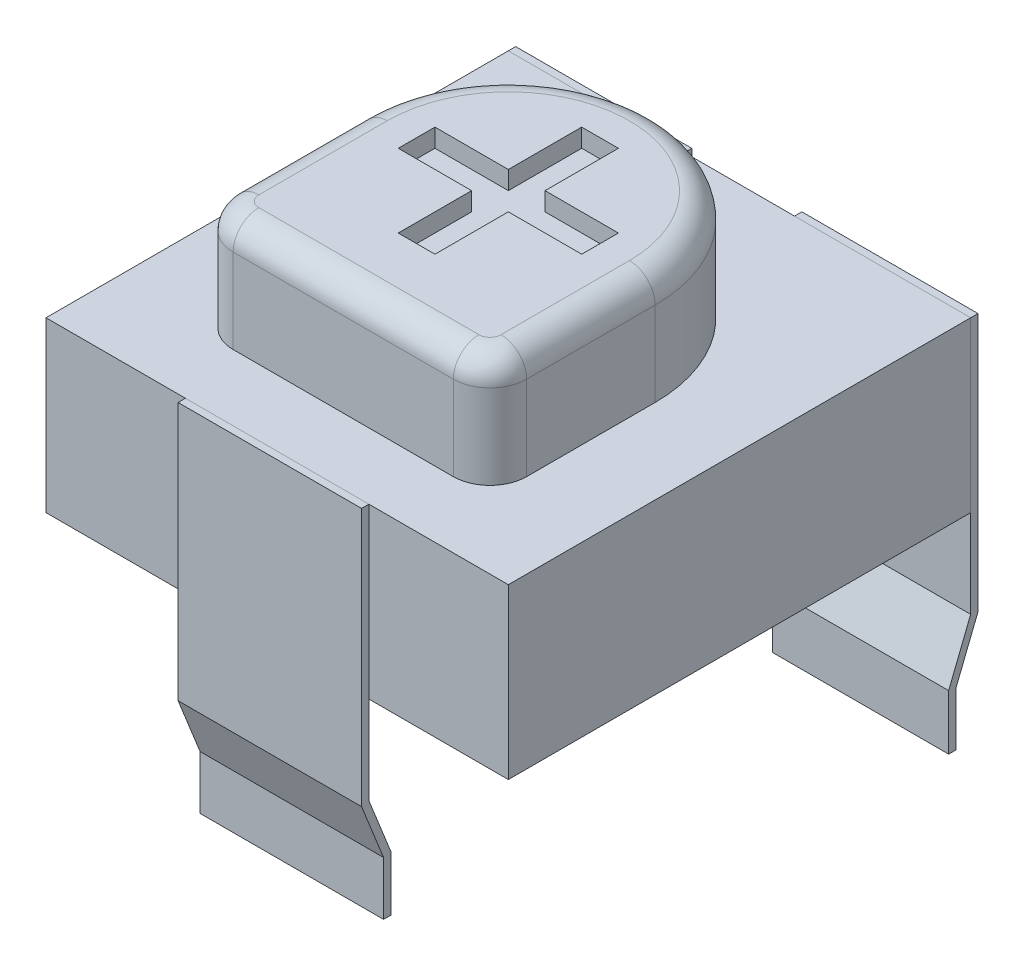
ISO-10303-21;
HEADER;
FILE_DESCRIPTION(('STEP AP214'),'2;1');
FILE_NAME('part.step','',(''),(''),'','','');
FILE_SCHEMA(('AUTOMOTIVE_DESIGN { 1 0 10303 214 1 1 1 1 }'));
ENDSEC;
DATA;
#1=APPLICATION_CONTEXT('core data for automotive mechanical design processes');
#2=APPLICATION_PROTOCOL_DEFINITION('international standard','automotive_design',2000,#1);
#3=PRODUCT_CONTEXT('',#1,'mechanical');
#4=PRODUCT('Part','Part','',(#3));
#5=PRODUCT_RELATED_PRODUCT_CATEGORY('part','',(#4));
#6=PRODUCT_DEFINITION_FORMATION('','',#4);
#7=PRODUCT_DEFINITION_CONTEXT('part definition',#1,'design');
#8=PRODUCT_DEFINITION('design','',#6,#7);
#9=PRODUCT_DEFINITION_SHAPE('','',#8);
#10=(LENGTH_UNIT() NAMED_UNIT(*) SI_UNIT(.MILLI.,.METRE.));
#11=(NAMED_UNIT(*) PLANE_ANGLE_UNIT() SI_UNIT($,.RADIAN.));
#12=(NAMED_UNIT(*) SI_UNIT($,.STERADIAN.) SOLID_ANGLE_UNIT());
#13=UNCERTAINTY_MEASURE_WITH_UNIT(LENGTH_MEASURE(1.E-05),#10,'distance_accuracy_value','');
#14=(GEOMETRIC_REPRESENTATION_CONTEXT(3) GLOBAL_UNCERTAINTY_ASSIGNED_CONTEXT((#13)) GLOBAL_UNIT_ASSIGNED_CONTEXT((#10,
#11,#12)) REPRESENTATION_CONTEXT('',''));
#15=CARTESIAN_POINT('',(0.,0.,0.));
#16=DIRECTION('',(0.,0.,1.));
#17=DIRECTION('',(1.,0.,0.));
#18=AXIS2_PLACEMENT_3D('',#15,#16,#17);
#19=CARTESIAN_POINT('',(4.4,2.3,0.));
#20=DIRECTION('',(0.,-1.,0.));
#21=DIRECTION('',(0.,0.,-1.));
#22=AXIS2_PLACEMENT_3D('',#19,#20,#21);
#23=PLANE('',#22);
#24=DIRECTION('',(0.,0.,1.));
#25=VECTOR('',#24,1.);
#26=CARTESIAN_POINT('',(1.9,2.3,0.));
#27=LINE('',#26,#25);
#28=CARTESIAN_POINT('',(1.9,2.3,0.));
#29=VERTEX_POINT('',#28);
#30=CARTESIAN_POINT('',(1.9,2.3,0.1));
#31=VERTEX_POINT('',#30);
#32=EDGE_CURVE('P0_E11',#29,#31,#27,.T.);
#33=ORIENTED_EDGE('',*,*,#32,.T.);
#34=DIRECTION('',(-1.,0.,0.));
#35=VECTOR('',#34,1.);
#36=CARTESIAN_POINT('',(4.4,2.3,0.1));
#37=LINE('',#36,#35);
#38=CARTESIAN_POINT('',(4.4,2.3,0.1));
#39=VERTEX_POINT('',#38);
#40=EDGE_CURVE('P0_E36',#39,#31,#37,.T.);
#41=ORIENTED_EDGE('',*,*,#40,.F.);
#42=DIRECTION('',(0.,0.,1.));
#43=VECTOR('',#42,1.);
#44=CARTESIAN_POINT('',(4.4,2.3,0.));
#45=LINE('',#44,#43);
#46=CARTESIAN_POINT('',(4.4,2.3,0.));
#47=VERTEX_POINT('',#46);
#48=EDGE_CURVE('P0_E98',#47,#39,#45,.T.);
#49=ORIENTED_EDGE('',*,*,#48,.F.);
#50=DIRECTION('',(-1.,0.,0.));
#51=VECTOR('',#50,1.);
#52=CARTESIAN_POINT('',(4.4,2.3,0.));
#53=LINE('',#52,#51);
#54=EDGE_CURVE('P0_E27',#47,#29,#53,.T.);
#55=ORIENTED_EDGE('',*,*,#54,.T.);
#56=EDGE_LOOP('',(#33,#41,#49,#55));
#57=FACE_BOUND('',#56,.T.);
#58=ADVANCED_FACE('P0_F17',(#57),#23,.F.);
#59=CARTESIAN_POINT('',(4.4,2.3,0.1));
#60=DIRECTION('',(0.,0.,-1.));
#61=DIRECTION('',(-1.,0.,0.));
#62=AXIS2_PLACEMENT_3D('',#59,#60,#61);
#63=PLANE('',#62);
#64=DIRECTION('',(0.,-1.,0.));
#65=VECTOR('',#64,1.);
#66=CARTESIAN_POINT('',(1.9,2.3,0.1));
#67=LINE('',#66,#65);
#68=CARTESIAN_POINT('',(1.9,-1.21925824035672,0.1));
#69=VERTEX_POINT('',#68);
#70=EDGE_CURVE('P0_E105',#31,#69,#67,.T.);
#71=ORIENTED_EDGE('',*,*,#70,.T.);
#72=DIRECTION('',(-1.,0.,0.));
#73=VECTOR('',#72,1.);
#74=CARTESIAN_POINT('',(4.4,-1.21925824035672,0.1));
#75=LINE('',#74,#73);
#76=CARTESIAN_POINT('',(4.4,-1.21925824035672,0.1));
#77=VERTEX_POINT('',#76);
#78=EDGE_CURVE('P0_E111',#77,#69,#75,.T.);
#79=ORIENTED_EDGE('',*,*,#78,.F.);
#80=DIRECTION('',(0.,-1.,0.));
#81=VECTOR('',#80,1.);
#82=CARTESIAN_POINT('',(4.4,2.3,0.1));
#83=LINE('',#82,#81);
#84=EDGE_CURVE('P0_E115',#39,#77,#83,.T.);
#85=ORIENTED_EDGE('',*,*,#84,.F.);
#86=ORIENTED_EDGE('',*,*,#40,.T.);
#87=EDGE_LOOP('',(#71,#79,#85,#86));
#88=FACE_BOUND('',#87,.T.);
#89=ADVANCED_FACE('P0_F151',(#88),#63,.F.);
#90=CARTESIAN_POINT('',(4.4,-1.21925824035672,0.1));
#91=DIRECTION('',(0.,0.371390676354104,-0.928476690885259));
#92=DIRECTION('',(0.,0.928476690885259,0.371390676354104));
#93=AXIS2_PLACEMENT_3D('',#90,#91,#92);
#94=PLANE('',#93);
#95=DIRECTION('',(0.,-0.928476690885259,-0.371390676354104));
#96=VECTOR('',#95,1.);
#97=CARTESIAN_POINT('',(1.9,-1.21925824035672,0.1));
#98=LINE('',#97,#96);
#99=CARTESIAN_POINT('',(1.9,-1.96925824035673,-0.2));
#100=VERTEX_POINT('',#99);
#101=EDGE_CURVE('P0_E113',#69,#100,#98,.T.);
#102=ORIENTED_EDGE('',*,*,#101,.T.);
#103=DIRECTION('',(-1.,0.,0.));
#104=VECTOR('',#103,1.);
#105=CARTESIAN_POINT('',(4.4,-1.96925824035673,-0.2));
#106=LINE('',#105,#104);
#107=CARTESIAN_POINT('',(4.4,-1.96925824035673,-0.2));
#108=VERTEX_POINT('',#107);
#109=EDGE_CURVE('P0_E120',#108,#100,#106,.T.);
#110=ORIENTED_EDGE('',*,*,#109,.F.);
#111=DIRECTION('',(0.,-0.928476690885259,-0.371390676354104));
#112=VECTOR('',#111,1.);
#113=CARTESIAN_POINT('',(4.4,-1.21925824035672,0.1));
#114=LINE('',#113,#112);
#115=EDGE_CURVE('P0_E117',#77,#108,#114,.T.);
#116=ORIENTED_EDGE('',*,*,#115,.F.);
#117=ORIENTED_EDGE('',*,*,#78,.T.);
#118=EDGE_LOOP('',(#102,#110,#116,#117));
#119=FACE_BOUND('',#118,.T.);
#120=ADVANCED_FACE('P0_F157',(#119),#94,.F.);
#121=CARTESIAN_POINT('',(4.4,-1.96925824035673,-0.2));
#122=DIRECTION('',(0.,0.,-1.));
#123=DIRECTION('',(-1.,0.,0.));
#124=AXIS2_PLACEMENT_3D('',#121,#122,#123);
#125=PLANE('',#124);
#126=DIRECTION('',(0.,-1.,0.));
#127=VECTOR('',#126,1.);
#128=CARTESIAN_POINT('',(1.9,-1.96925824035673,-0.2));
#129=LINE('',#128,#127);
#130=CARTESIAN_POINT('',(1.9,-2.7,-0.2));
#131=VERTEX_POINT('',#130);
#132=EDGE_CURVE('P0_E114',#100,#131,#129,.T.);
#133=ORIENTED_EDGE('',*,*,#132,.T.);
#134=DIRECTION('',(-1.,0.,0.));
#135=VECTOR('',#134,1.);
#136=CARTESIAN_POINT('',(4.4,-2.7,-0.2));
#137=LINE('',#136,#135);
#138=CARTESIAN_POINT('',(4.4,-2.7,-0.2));
#139=VERTEX_POINT('',#138);
#140=EDGE_CURVE('P0_E127',#139,#131,#137,.T.);
#141=ORIENTED_EDGE('',*,*,#140,.F.);
#142=DIRECTION('',(0.,-1.,0.));
#143=VECTOR('',#142,1.);
#144=CARTESIAN_POINT('',(4.4,-1.96925824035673,-0.2));
#145=LINE('',#144,#143);
#146=EDGE_CURVE('P0_E124',#108,#139,#145,.T.);
#147=ORIENTED_EDGE('',*,*,#146,.F.);
#148=ORIENTED_EDGE('',*,*,#109,.T.);
#149=EDGE_LOOP('',(#133,#141,#147,#148));
#150=FACE_BOUND('',#149,.T.);
#151=ADVANCED_FACE('P0_F160',(#150),#125,.F.);
#152=CARTESIAN_POINT('',(4.4,-2.7,-0.3));
#153=DIRECTION('',(0.,1.,0.));
#154=DIRECTION('',(0.,0.,1.));
#155=AXIS2_PLACEMENT_3D('',#152,#153,#154);
#156=PLANE('',#155);
#157=DIRECTION('',(0.,0.,-1.));
#158=VECTOR('',#157,1.);
#159=CARTESIAN_POINT('',(1.9,-2.7,-0.3));
#160=LINE('',#159,#158);
#161=CARTESIAN_POINT('',(1.9,-2.7,-0.3));
#162=VERTEX_POINT('',#161);
#163=EDGE_CURVE('P0_E122',#131,#162,#160,.T.);
#164=ORIENTED_EDGE('',*,*,#163,.T.);
#165=DIRECTION('',(-1.,0.,0.));
#166=VECTOR('',#165,1.);
#167=CARTESIAN_POINT('',(4.4,-2.7,-0.3));
#168=LINE('',#167,#166);
#169=CARTESIAN_POINT('',(4.4,-2.7,-0.3));
#170=VERTEX_POINT('',#169);
#171=EDGE_CURVE('P0_E134',#170,#162,#168,.T.);
#172=ORIENTED_EDGE('',*,*,#171,.F.);
#173=DIRECTION('',(0.,0.,-1.));
#174=VECTOR('',#173,1.);
#175=CARTESIAN_POINT('',(4.4,-2.7,-0.3));
#176=LINE('',#175,#174);
#177=EDGE_CURVE('P0_E131',#139,#170,#176,.T.);
#178=ORIENTED_EDGE('',*,*,#177,.F.);
#179=ORIENTED_EDGE('',*,*,#140,.T.);
#180=EDGE_LOOP('',(#164,#172,#178,#179));
#181=FACE_BOUND('',#180,.T.);
#182=ADVANCED_FACE('P0_F163',(#181),#156,.F.);
#183=CARTESIAN_POINT('',(4.4,-1.95,-0.3));
#184=DIRECTION('',(0.,0.,1.));
#185=DIRECTION('',(0.,-1.,0.));
#186=AXIS2_PLACEMENT_3D('',#183,#184,#185);
#187=PLANE('',#186);
#188=DIRECTION('',(0.,1.,0.));
#189=VECTOR('',#188,1.);
#190=CARTESIAN_POINT('',(1.9,-1.95,-0.3));
#191=LINE('',#190,#189);
#192=CARTESIAN_POINT('',(1.9,-1.95,-0.3));
#193=VERTEX_POINT('',#192);
#194=EDGE_CURVE('P0_E129',#162,#193,#191,.T.);
#195=ORIENTED_EDGE('',*,*,#194,.T.);
#196=DIRECTION('',(-1.,0.,0.));
#197=VECTOR('',#196,1.);
#198=CARTESIAN_POINT('',(4.4,-1.95,-0.3));
#199=LINE('',#198,#197);
#200=CARTESIAN_POINT('',(4.4,-1.95,-0.3));
#201=VERTEX_POINT('',#200);
#202=EDGE_CURVE('P0_E139',#201,#193,#199,.T.);
#203=ORIENTED_EDGE('',*,*,#202,.F.);
#204=DIRECTION('',(0.,1.,0.));
#205=VECTOR('',#204,1.);
#206=CARTESIAN_POINT('',(4.4,-1.95,-0.3));
#207=LINE('',#206,#205);
#208=EDGE_CURVE('P0_E89',#170,#201,#207,.T.);
#209=ORIENTED_EDGE('',*,*,#208,.F.);
#210=ORIENTED_EDGE('',*,*,#171,.T.);
#211=EDGE_LOOP('',(#195,#203,#209,#210));
#212=FACE_BOUND('',#211,.T.);
#213=ADVANCED_FACE('P0_F144',(#212),#187,.F.);
#214=CARTESIAN_POINT('',(4.4,-1.2,0.));
#215=DIRECTION('',(0.,-0.371390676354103,0.928476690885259));
#216=DIRECTION('',(0.,-0.928476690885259,-0.371390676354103));
#217=AXIS2_PLACEMENT_3D('',#214,#215,#216);
#218=PLANE('',#217);
#219=DIRECTION('',(0.,0.928476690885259,0.371390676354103));
#220=VECTOR('',#219,1.);
#221=CARTESIAN_POINT('',(1.9,-1.2,0.));
#222=LINE('',#221,#220);
#223=CARTESIAN_POINT('',(1.9,-1.2,0.));
#224=VERTEX_POINT('',#223);
#225=EDGE_CURVE('P0_E95',#193,#224,#222,.T.);
#226=ORIENTED_EDGE('',*,*,#225,.T.);
#227=DIRECTION('',(-1.,0.,0.));
#228=VECTOR('',#227,1.);
#229=CARTESIAN_POINT('',(4.4,-1.2,0.));
#230=LINE('',#229,#228);
#231=CARTESIAN_POINT('',(4.4,-1.2,0.));
#232=VERTEX_POINT('',#231);
#233=EDGE_CURVE('P0_E80',#232,#224,#230,.T.);
#234=ORIENTED_EDGE('',*,*,#233,.F.);
#235=DIRECTION('',(0.,0.928476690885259,0.371390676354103));
#236=VECTOR('',#235,1.);
#237=CARTESIAN_POINT('',(4.4,-1.2,0.));
#238=LINE('',#237,#236);
#239=EDGE_CURVE('P0_E86',#201,#232,#238,.T.);
#240=ORIENTED_EDGE('',*,*,#239,.F.);
#241=ORIENTED_EDGE('',*,*,#202,.T.);
#242=EDGE_LOOP('',(#226,#234,#240,#241));
#243=FACE_BOUND('',#242,.T.);
#244=ADVANCED_FACE('P0_F93',(#243),#218,.F.);
#245=CARTESIAN_POINT('',(4.4,2.3,0.));
#246=DIRECTION('',(0.,0.,1.));
#247=DIRECTION('',(0.,-1.,0.));
#248=AXIS2_PLACEMENT_3D('',#245,#246,#247);
#249=PLANE('',#248);
#250=DIRECTION('',(0.,1.,0.));
#251=VECTOR('',#250,1.);
#252=CARTESIAN_POINT('',(1.9,2.3,0.));
#253=LINE('',#252,#251);
#254=EDGE_CURVE('P0_E97',#224,#29,#253,.T.);
#255=ORIENTED_EDGE('',*,*,#254,.T.);
#256=ORIENTED_EDGE('',*,*,#54,.F.);
#257=DIRECTION('',(0.,1.,0.));
#258=VECTOR('',#257,1.);
#259=CARTESIAN_POINT('',(4.4,2.3,0.));
#260=LINE('',#259,#258);
#261=EDGE_CURVE('P0_E21',#232,#47,#260,.T.);
#262=ORIENTED_EDGE('',*,*,#261,.F.);
#263=ORIENTED_EDGE('',*,*,#233,.T.);
#264=EDGE_LOOP('',(#255,#256,#262,#263));
#265=FACE_BOUND('',#264,.T.);
#266=ADVANCED_FACE('P0_F101',(#265),#249,.F.);
#267=CARTESIAN_POINT('',(4.4,2.3,0.1));
#268=DIRECTION('',(1.,0.,0.));
#269=DIRECTION('',(0.,0.,-1.));
#270=AXIS2_PLACEMENT_3D('',#267,#268,#269);
#271=PLANE('',#270);
#272=ORIENTED_EDGE('',*,*,#48,.T.);
#273=ORIENTED_EDGE('',*,*,#84,.T.);
#274=ORIENTED_EDGE('',*,*,#115,.T.);
#275=ORIENTED_EDGE('',*,*,#146,.T.);
#276=ORIENTED_EDGE('',*,*,#177,.T.);
#277=ORIENTED_EDGE('',*,*,#208,.T.);
#278=ORIENTED_EDGE('',*,*,#239,.T.);
#279=ORIENTED_EDGE('',*,*,#261,.T.);
#280=EDGE_LOOP('',(#272,#273,#274,#275,#276,#277,#278,#279));
#281=FACE_BOUND('',#280,.T.);
#282=ADVANCED_FACE('P0_F87',(#281),#271,.T.);
#283=CARTESIAN_POINT('',(1.9,2.3,0.1));
#284=DIRECTION('',(1.,0.,0.));
#285=DIRECTION('',(0.,0.,-1.));
#286=AXIS2_PLACEMENT_3D('',#283,#284,#285);
#287=PLANE('',#286);
#288=ORIENTED_EDGE('',*,*,#32,.F.);
#289=ORIENTED_EDGE('',*,*,#254,.F.);
#290=ORIENTED_EDGE('',*,*,#225,.F.);
#291=ORIENTED_EDGE('',*,*,#194,.F.);
#292=ORIENTED_EDGE('',*,*,#163,.F.);
#293=ORIENTED_EDGE('',*,*,#132,.F.);
#294=ORIENTED_EDGE('',*,*,#101,.F.);
#295=ORIENTED_EDGE('',*,*,#70,.F.);
#296=EDGE_LOOP('',(#288,#289,#290,#291,#292,#293,#294,#295));
#297=FACE_BOUND('',#296,.T.);
#298=ADVANCED_FACE('P0_F19',(#297),#287,.F.);
#299=CLOSED_SHELL('',(#58,#89,#120,#151,#182,#213,#244,#266,#282,#298));
#300=MANIFOLD_SOLID_BREP('P0_B1',#299);
#301=CARTESIAN_POINT('',(3.15,3.45,-3.15));
#302=DIRECTION('',(0.,-1.,0.));
#303=DIRECTION('',(0.,0.,-1.));
#304=AXIS2_PLACEMENT_3D('',#301,#302,#303);
#305=TOROIDAL_SURFACE('',#304,1.65,0.35);
#306=CARTESIAN_POINT('',(3.15,3.8,-3.15));
#307=DIRECTION('',(0.,1.,0.));
#308=DIRECTION('',(0.,0.,-1.));
#309=AXIS2_PLACEMENT_3D('',#306,#307,#308);
#310=CIRCLE('',#309,1.65);
#311=CARTESIAN_POINT('',(4.8,3.8,-3.15));
#312=VERTEX_POINT('',#311);
#313=CARTESIAN_POINT('',(1.5,3.8,-3.15));
#314=VERTEX_POINT('',#313);
#315=EDGE_CURVE('P1_E293',#312,#314,#310,.T.);
#316=ORIENTED_EDGE('',*,*,#315,.F.);
#317=CARTESIAN_POINT('',(4.8,3.45,-3.15));
#318=DIRECTION('',(0.,0.,-1.));
#319=DIRECTION('',(-1.,0.,0.));
#320=AXIS2_PLACEMENT_3D('',#317,#318,#319);
#321=CIRCLE('',#320,0.35);
#322=CARTESIAN_POINT('',(5.15,3.45,-3.15));
#323=VERTEX_POINT('',#322);
#324=EDGE_CURVE('P1_E297',#312,#323,#321,.T.);
#325=ORIENTED_EDGE('',*,*,#324,.T.);
#326=CARTESIAN_POINT('',(3.15,3.45,-3.15));
#327=DIRECTION('',(0.,-1.,0.));
#328=DIRECTION('',(0.,0.,-1.));
#329=AXIS2_PLACEMENT_3D('',#326,#327,#328);
#330=CIRCLE('',#329,2.);
#331=CARTESIAN_POINT('',(1.15,3.45,-3.15));
#332=VERTEX_POINT('',#331);
#333=EDGE_CURVE('P1_E11',#332,#323,#330,.T.);
#334=ORIENTED_EDGE('',*,*,#333,.F.);
#335=CARTESIAN_POINT('',(1.5,3.45,-3.15));
#336=DIRECTION('',(0.,0.,1.));
#337=DIRECTION('',(1.,0.,0.));
#338=AXIS2_PLACEMENT_3D('',#335,#336,#337);
#339=CIRCLE('',#338,0.35);
#340=EDGE_CURVE('P1_E36',#314,#332,#339,.T.);
#341=ORIENTED_EDGE('',*,*,#340,.F.);
#342=EDGE_LOOP('',(#316,#325,#334,#341));
#343=FACE_BOUND('',#342,.T.);
#344=ADVANCED_FACE('P1_F17',(#343),#305,.T.);
#345=CARTESIAN_POINT('',(3.15,3.8,-3.15));
#346=DIRECTION('',(0.,-1.,0.));
#347=DIRECTION('',(0.,0.,-1.));
#348=AXIS2_PLACEMENT_3D('',#345,#346,#347);
#349=CYLINDRICAL_SURFACE('',#348,2.);
#350=ORIENTED_EDGE('',*,*,#333,.T.);
#351=DIRECTION('',(0.,-1.,0.));
#352=VECTOR('',#351,1.);
#353=CARTESIAN_POINT('',(5.15,3.8,-3.15));
#354=LINE('',#353,#352);
#355=CARTESIAN_POINT('',(5.15,2.3,-3.15));
#356=VERTEX_POINT('',#355);
#357=EDGE_CURVE('P1_E704',#323,#356,#354,.T.);
#358=ORIENTED_EDGE('',*,*,#357,.T.);
#359=CARTESIAN_POINT('',(3.15,2.3,-3.15));
#360=DIRECTION('',(0.,1.,0.));
#361=DIRECTION('',(0.,0.,1.));
#362=AXIS2_PLACEMENT_3D('',#359,#360,#361);
#363=CIRCLE('',#362,2.);
#364=CARTESIAN_POINT('',(1.15,2.3,-3.15));
#365=VERTEX_POINT('',#364);
#366=EDGE_CURVE('P1_E27',#356,#365,#363,.T.);
#367=ORIENTED_EDGE('',*,*,#366,.T.);
#368=DIRECTION('',(0.,-1.,0.));
#369=VECTOR('',#368,1.);
#370=CARTESIAN_POINT('',(1.15,3.8,-3.15));
#371=LINE('',#370,#369);
#372=EDGE_CURVE('P1_E705',#332,#365,#371,.T.);
#373=ORIENTED_EDGE('',*,*,#372,.F.);
#374=EDGE_LOOP('',(#350,#358,#367,#373));
#375=FACE_BOUND('',#374,.T.);
#376=ADVANCED_FACE('P1_F370',(#375),#349,.T.);
#377=CARTESIAN_POINT('',(0.,2.3,-6.3));
#378=DIRECTION('',(0.,-1.,0.));
#379=DIRECTION('',(0.,0.,-1.));
#380=AXIS2_PLACEMENT_3D('',#377,#378,#379);
#381=PLANE('',#380);
#382=DIRECTION('',(0.,0.,1.));
#383=VECTOR('',#382,1.);
#384=CARTESIAN_POINT('',(0.,2.3,0.));
#385=LINE('',#384,#383);
#386=CARTESIAN_POINT('',(0.,2.3,-6.3));
#387=VERTEX_POINT('',#386);
#388=CARTESIAN_POINT('',(0.,2.3,0.));
#389=VERTEX_POINT('',#388);
#390=EDGE_CURVE('P1_E778',#387,#389,#385,.T.);
#391=ORIENTED_EDGE('',*,*,#390,.T.);
#392=DIRECTION('',(1.,0.,0.));
#393=VECTOR('',#392,1.);
#394=CARTESIAN_POINT('',(0.,2.3,0.));
#395=LINE('',#394,#393);
#396=CARTESIAN_POINT('',(6.3,2.3,0.));
#397=VERTEX_POINT('',#396);
#398=EDGE_CURVE('P1_E775',#389,#397,#395,.T.);
#399=ORIENTED_EDGE('',*,*,#398,.T.);
#400=DIRECTION('',(0.,0.,-1.));
#401=VECTOR('',#400,1.);
#402=CARTESIAN_POINT('',(6.3,2.3,0.));
#403=LINE('',#402,#401);
#404=CARTESIAN_POINT('',(6.3,2.3,-6.3));
#405=VERTEX_POINT('',#404);
#406=EDGE_CURVE('P1_E772',#397,#405,#403,.T.);
#407=ORIENTED_EDGE('',*,*,#406,.T.);
#408=DIRECTION('',(-1.,0.,0.));
#409=VECTOR('',#408,1.);
#410=CARTESIAN_POINT('',(0.,2.3,-6.3));
#411=LINE('',#410,#409);
#412=EDGE_CURVE('P1_E737',#405,#387,#411,.T.);
#413=ORIENTED_EDGE('',*,*,#412,.T.);
#414=EDGE_LOOP('',(#391,#399,#407,#413));
#415=FACE_BOUND('',#414,.T.);
#416=CARTESIAN_POINT('',(4.65,2.3,-1.4));
#417=DIRECTION('',(0.,1.,0.));
#418=DIRECTION('',(0.,0.,-1.));
#419=AXIS2_PLACEMENT_3D('',#416,#417,#418);
#420=CIRCLE('',#419,0.5);
#421=CARTESIAN_POINT('',(4.65,2.3,-0.9));
#422=VERTEX_POINT('',#421);
#423=CARTESIAN_POINT('',(5.15,2.3,-1.4));
#424=VERTEX_POINT('',#423);
#425=EDGE_CURVE('P1_E763',#422,#424,#420,.T.);
#426=ORIENTED_EDGE('',*,*,#425,.F.);
#427=DIRECTION('',(1.,0.,0.));
#428=VECTOR('',#427,1.);
#429=CARTESIAN_POINT('',(4.65,2.3,-0.9));
#430=LINE('',#429,#428);
#431=CARTESIAN_POINT('',(1.65,2.3,-0.899999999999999));
#432=VERTEX_POINT('',#431);
#433=EDGE_CURVE('P1_E280',#432,#422,#430,.T.);
#434=ORIENTED_EDGE('',*,*,#433,.F.);
#435=CARTESIAN_POINT('',(1.65,2.3,-1.4));
#436=DIRECTION('',(0.,1.,0.));
#437=DIRECTION('',(0.,0.,-1.));
#438=AXIS2_PLACEMENT_3D('',#435,#436,#437);
#439=CIRCLE('',#438,0.5);
#440=CARTESIAN_POINT('',(1.15,2.3,-1.4));
#441=VERTEX_POINT('',#440);
#442=EDGE_CURVE('P1_E721',#441,#432,#439,.T.);
#443=ORIENTED_EDGE('',*,*,#442,.F.);
#444=DIRECTION('',(0.,0.,1.));
#445=VECTOR('',#444,1.);
#446=CARTESIAN_POINT('',(1.15,2.3,-1.4));
#447=LINE('',#446,#445);
#448=EDGE_CURVE('P1_E710',#365,#441,#447,.T.);
#449=ORIENTED_EDGE('',*,*,#448,.F.);
#450=ORIENTED_EDGE('',*,*,#366,.F.);
#451=DIRECTION('',(0.,0.,-1.));
#452=VECTOR('',#451,1.);
#453=CARTESIAN_POINT('',(5.15,2.3,-3.15));
#454=LINE('',#453,#452);
#455=EDGE_CURVE('P1_E708',#424,#356,#454,.T.);
#456=ORIENTED_EDGE('',*,*,#455,.F.);
#457=EDGE_LOOP('',(#426,#434,#443,#449,#450,#456));
#458=FACE_BOUND('',#457,.T.);
#459=ADVANCED_FACE('P1_F376',(#415,#458),#381,.F.);
#460=CARTESIAN_POINT('',(0.,2.3,0.));
#461=DIRECTION('',(1.,0.,0.));
#462=DIRECTION('',(0.,0.,-1.));
#463=AXIS2_PLACEMENT_3D('',#460,#461,#462);
#464=PLANE('',#463);
#465=DIRECTION('',(0.,0.,1.));
#466=VECTOR('',#465,1.);
#467=CARTESIAN_POINT('',(0.,0.,0.));
#468=LINE('',#467,#466);
#469=CARTESIAN_POINT('',(0.,0.,-6.3));
#470=VERTEX_POINT('',#469);
#471=CARTESIAN_POINT('',(0.,0.,0.));
#472=VERTEX_POINT('',#471);
#473=EDGE_CURVE('P1_E734',#470,#472,#468,.T.);
#474=ORIENTED_EDGE('',*,*,#473,.T.);
#475=DIRECTION('',(0.,-1.,0.));
#476=VECTOR('',#475,1.);
#477=CARTESIAN_POINT('',(0.,2.3,0.));
#478=LINE('',#477,#476);
#479=EDGE_CURVE('P1_E739',#389,#472,#478,.T.);
#480=ORIENTED_EDGE('',*,*,#479,.F.);
#481=ORIENTED_EDGE('',*,*,#390,.F.);
#482=DIRECTION('',(0.,-1.,0.));
#483=VECTOR('',#482,1.);
#484=CARTESIAN_POINT('',(0.,2.3,-6.3));
#485=LINE('',#484,#483);
#486=EDGE_CURVE('P1_E738',#387,#470,#485,.T.);
#487=ORIENTED_EDGE('',*,*,#486,.T.);
#488=EDGE_LOOP('',(#474,#480,#481,#487));
#489=FACE_BOUND('',#488,.T.);
#490=ADVANCED_FACE('P1_F382',(#489),#464,.F.);
#491=CARTESIAN_POINT('',(0.,2.3,0.));
#492=DIRECTION('',(0.,0.,-1.));
#493=DIRECTION('',(-1.,0.,0.));
#494=AXIS2_PLACEMENT_3D('',#491,#492,#493);
#495=PLANE('',#494);
#496=DIRECTION('',(1.,0.,0.));
#497=VECTOR('',#496,1.);
#498=CARTESIAN_POINT('',(0.,0.,0.));
#499=LINE('',#498,#497);
#500=CARTESIAN_POINT('',(6.3,0.,0.));
#501=VERTEX_POINT('',#500);
#502=EDGE_CURVE('P1_E741',#472,#501,#499,.T.);
#503=ORIENTED_EDGE('',*,*,#502,.T.);
#504=DIRECTION('',(0.,-1.,0.));
#505=VECTOR('',#504,1.);
#506=CARTESIAN_POINT('',(6.3,2.3,0.));
#507=LINE('',#506,#505);
#508=EDGE_CURVE('P1_E746',#397,#501,#507,.T.);
#509=ORIENTED_EDGE('',*,*,#508,.F.);
#510=ORIENTED_EDGE('',*,*,#398,.F.);
#511=ORIENTED_EDGE('',*,*,#479,.T.);
#512=EDGE_LOOP('',(#503,#509,#510,#511));
#513=FACE_BOUND('',#512,.T.);
#514=ADVANCED_FACE('P1_F386',(#513),#495,.F.);
#515=CARTESIAN_POINT('',(6.3,2.3,0.));
#516=DIRECTION('',(-1.,0.,0.));
#517=DIRECTION('',(0.,0.,1.));
#518=AXIS2_PLACEMENT_3D('',#515,#516,#517);
#519=PLANE('',#518);
#520=DIRECTION('',(0.,0.,-1.));
#521=VECTOR('',#520,1.);
#522=CARTESIAN_POINT('',(6.3,0.,0.));
#523=LINE('',#522,#521);
#524=CARTESIAN_POINT('',(6.3,0.,-6.3));
#525=VERTEX_POINT('',#524);
#526=EDGE_CURVE('P1_E742',#501,#525,#523,.T.);
#527=ORIENTED_EDGE('',*,*,#526,.T.);
#528=DIRECTION('',(0.,-1.,0.));
#529=VECTOR('',#528,1.);
#530=CARTESIAN_POINT('',(6.3,2.3,-6.3));
#531=LINE('',#530,#529);
#532=EDGE_CURVE('P1_E751',#405,#525,#531,.T.);
#533=ORIENTED_EDGE('',*,*,#532,.F.);
#534=ORIENTED_EDGE('',*,*,#406,.F.);
#535=ORIENTED_EDGE('',*,*,#508,.T.);
#536=EDGE_LOOP('',(#527,#533,#534,#535));
#537=FACE_BOUND('',#536,.T.);
#538=ADVANCED_FACE('P1_F390',(#537),#519,.F.);
#539=CARTESIAN_POINT('',(0.,2.3,-6.3));
#540=DIRECTION('',(0.,0.,1.));
#541=DIRECTION('',(1.,0.,0.));
#542=AXIS2_PLACEMENT_3D('',#539,#540,#541);
#543=PLANE('',#542);
#544=DIRECTION('',(-1.,0.,0.));
#545=VECTOR('',#544,1.);
#546=CARTESIAN_POINT('',(0.,0.,-6.3));
#547=LINE('',#546,#545);
#548=EDGE_CURVE('P1_E748',#525,#470,#547,.T.);
#549=ORIENTED_EDGE('',*,*,#548,.T.);
#550=ORIENTED_EDGE('',*,*,#486,.F.);
#551=ORIENTED_EDGE('',*,*,#412,.F.);
#552=ORIENTED_EDGE('',*,*,#532,.T.);
#553=EDGE_LOOP('',(#549,#550,#551,#552));
#554=FACE_BOUND('',#553,.T.);
#555=ADVANCED_FACE('P1_F394',(#554),#543,.F.);
#556=CARTESIAN_POINT('',(0.,0.,-6.3));
#557=DIRECTION('',(0.,-1.,0.));
#558=DIRECTION('',(0.,0.,-1.));
#559=AXIS2_PLACEMENT_3D('',#556,#557,#558);
#560=PLANE('',#559);
#561=ORIENTED_EDGE('',*,*,#473,.F.);
#562=ORIENTED_EDGE('',*,*,#548,.F.);
#563=ORIENTED_EDGE('',*,*,#526,.F.);
#564=ORIENTED_EDGE('',*,*,#502,.F.);
#565=EDGE_LOOP('',(#561,#562,#563,#564));
#566=FACE_BOUND('',#565,.T.);
#567=ADVANCED_FACE('P1_F398',(#566),#560,.T.);
#568=CARTESIAN_POINT('',(4.65,3.8,-1.4));
#569=DIRECTION('',(0.,-1.,0.));
#570=DIRECTION('',(0.,0.,-1.));
#571=AXIS2_PLACEMENT_3D('',#568,#569,#570);
#572=CYLINDRICAL_SURFACE('',#571,0.5);
#573=DIRECTION('',(0.,-1.,0.));
#574=VECTOR('',#573,1.);
#575=CARTESIAN_POINT('',(5.15,3.8,-1.4));
#576=LINE('',#575,#574);
#577=CARTESIAN_POINT('',(5.15,3.45,-1.4));
#578=VERTEX_POINT('',#577);
#579=EDGE_CURVE('P1_E733',#578,#424,#576,.T.);
#580=ORIENTED_EDGE('',*,*,#579,.F.);
#581=CARTESIAN_POINT('',(4.65,3.45,-1.4));
#582=DIRECTION('',(0.,-1.,0.));
#583=DIRECTION('',(0.,0.,-1.));
#584=AXIS2_PLACEMENT_3D('',#581,#582,#583);
#585=CIRCLE('',#584,0.5);
#586=CARTESIAN_POINT('',(4.65,3.45,-0.9));
#587=VERTEX_POINT('',#586);
#588=EDGE_CURVE('P1_E753',#578,#587,#585,.T.);
#589=ORIENTED_EDGE('',*,*,#588,.T.);
#590=DIRECTION('',(0.,-1.,0.));
#591=VECTOR('',#590,1.);
#592=CARTESIAN_POINT('',(4.65,3.8,-0.9));
#593=LINE('',#592,#591);
#594=EDGE_CURVE('P1_E761',#587,#422,#593,.T.);
#595=ORIENTED_EDGE('',*,*,#594,.T.);
#596=ORIENTED_EDGE('',*,*,#425,.T.);
#597=EDGE_LOOP('',(#580,#589,#595,#596));
#598=FACE_BOUND('',#597,.T.);
#599=ADVANCED_FACE('P1_F402',(#598),#572,.T.);
#600=CARTESIAN_POINT('',(5.15,3.8,-3.15));
#601=DIRECTION('',(-1.,0.,0.));
#602=DIRECTION('',(0.,0.,1.));
#603=AXIS2_PLACEMENT_3D('',#600,#601,#602);
#604=PLANE('',#603);
#605=ORIENTED_EDGE('',*,*,#357,.F.);
#606=DIRECTION('',(0.,0.,1.));
#607=VECTOR('',#606,1.);
#608=CARTESIAN_POINT('',(5.15,3.45,-3.15));
#609=LINE('',#608,#607);
#610=EDGE_CURVE('P1_E758',#323,#578,#609,.T.);
#611=ORIENTED_EDGE('',*,*,#610,.T.);
#612=ORIENTED_EDGE('',*,*,#579,.T.);
#613=ORIENTED_EDGE('',*,*,#455,.T.);
#614=EDGE_LOOP('',(#605,#611,#612,#613));
#615=FACE_BOUND('',#614,.T.);
#616=ADVANCED_FACE('P1_F406',(#615),#604,.F.);
#617=CARTESIAN_POINT('',(1.15,3.8,-1.4));
#618=DIRECTION('',(1.,0.,0.));
#619=DIRECTION('',(0.,0.,-1.));
#620=AXIS2_PLACEMENT_3D('',#617,#618,#619);
#621=PLANE('',#620);
#622=DIRECTION('',(0.,-1.,0.));
#623=VECTOR('',#622,1.);
#624=CARTESIAN_POINT('',(1.15,3.8,-1.4));
#625=LINE('',#624,#623);
#626=CARTESIAN_POINT('',(1.15,3.45,-1.4));
#627=VERTEX_POINT('',#626);
#628=EDGE_CURVE('P1_E714',#627,#441,#625,.T.);
#629=ORIENTED_EDGE('',*,*,#628,.F.);
#630=DIRECTION('',(0.,0.,-1.));
#631=VECTOR('',#630,1.);
#632=CARTESIAN_POINT('',(1.15,3.45,-1.4));
#633=LINE('',#632,#631);
#634=EDGE_CURVE('P1_E703',#627,#332,#633,.T.);
#635=ORIENTED_EDGE('',*,*,#634,.T.);
#636=ORIENTED_EDGE('',*,*,#372,.T.);
#637=ORIENTED_EDGE('',*,*,#448,.T.);
#638=EDGE_LOOP('',(#629,#635,#636,#637));
#639=FACE_BOUND('',#638,.T.);
#640=ADVANCED_FACE('P1_F410',(#639),#621,.F.);
#641=CARTESIAN_POINT('',(1.65,3.8,-1.4));
#642=DIRECTION('',(0.,-1.,0.));
#643=DIRECTION('',(0.,0.,-1.));
#644=AXIS2_PLACEMENT_3D('',#641,#642,#643);
#645=CYLINDRICAL_SURFACE('',#644,0.5);
#646=DIRECTION('',(0.,-1.,0.));
#647=VECTOR('',#646,1.);
#648=CARTESIAN_POINT('',(1.65,3.8,-0.9));
#649=LINE('',#648,#647);
#650=CARTESIAN_POINT('',(1.65,3.45,-0.9));
#651=VERTEX_POINT('',#650);
#652=EDGE_CURVE('P1_E716',#651,#432,#649,.T.);
#653=ORIENTED_EDGE('',*,*,#652,.F.);
#654=CARTESIAN_POINT('',(1.65,3.45,-1.4));
#655=DIRECTION('',(0.,-1.,0.));
#656=DIRECTION('',(0.,0.,-1.));
#657=AXIS2_PLACEMENT_3D('',#654,#655,#656);
#658=CIRCLE('',#657,0.5);
#659=EDGE_CURVE('P1_E701',#651,#627,#658,.T.);
#660=ORIENTED_EDGE('',*,*,#659,.T.);
#661=ORIENTED_EDGE('',*,*,#628,.T.);
#662=ORIENTED_EDGE('',*,*,#442,.T.);
#663=EDGE_LOOP('',(#653,#660,#661,#662));
#664=FACE_BOUND('',#663,.T.);
#665=ADVANCED_FACE('P1_F414',(#664),#645,.T.);
#666=CARTESIAN_POINT('',(4.65,3.8,-0.9));
#667=DIRECTION('',(0.,0.,-1.));
#668=DIRECTION('',(-1.,0.,0.));
#669=AXIS2_PLACEMENT_3D('',#666,#667,#668);
#670=PLANE('',#669);
#671=ORIENTED_EDGE('',*,*,#594,.F.);
#672=DIRECTION('',(-1.,0.,0.));
#673=VECTOR('',#672,1.);
#674=CARTESIAN_POINT('',(4.65,3.45,-0.9));
#675=LINE('',#674,#673);
#676=EDGE_CURVE('P1_E719',#587,#651,#675,.T.);
#677=ORIENTED_EDGE('',*,*,#676,.T.);
#678=ORIENTED_EDGE('',*,*,#652,.T.);
#679=ORIENTED_EDGE('',*,*,#433,.T.);
#680=EDGE_LOOP('',(#671,#677,#678,#679));
#681=FACE_BOUND('',#680,.T.);
#682=ADVANCED_FACE('P1_F418',(#681),#670,.F.);
#683=CARTESIAN_POINT('',(4.65,3.8,-1.4));
#684=DIRECTION('',(0.,-1.,0.));
#685=DIRECTION('',(0.,0.,-1.));
#686=AXIS2_PLACEMENT_3D('',#683,#684,#685);
#687=PLANE('',#686);
#688=DIRECTION('',(-1.,0.,0.));
#689=VECTOR('',#688,1.);
#690=CARTESIAN_POINT('',(3.4,3.8,-4.4));
#691=LINE('',#690,#689);
#692=CARTESIAN_POINT('',(3.4,3.8,-4.4));
#693=VERTEX_POINT('',#692);
#694=CARTESIAN_POINT('',(2.9,3.8,-4.4));
#695=VERTEX_POINT('',#694);
#696=EDGE_CURVE('P1_E200',#693,#695,#691,.T.);
#697=ORIENTED_EDGE('',*,*,#696,.F.);
#698=DIRECTION('',(0.,0.,-1.));
#699=VECTOR('',#698,1.);
#700=CARTESIAN_POINT('',(3.4,3.8,-4.4));
#701=LINE('',#700,#699);
#702=CARTESIAN_POINT('',(3.4,3.8,-3.4));
#703=VERTEX_POINT('',#702);
#704=EDGE_CURVE('P1_E214',#703,#693,#701,.T.);
#705=ORIENTED_EDGE('',*,*,#704,.F.);
#706=DIRECTION('',(-1.,0.,0.));
#707=VECTOR('',#706,1.);
#708=CARTESIAN_POINT('',(4.4,3.8,-3.4));
#709=LINE('',#708,#707);
#710=CARTESIAN_POINT('',(4.4,3.8,-3.4));
#711=VERTEX_POINT('',#710);
#712=EDGE_CURVE('P1_E215',#711,#703,#709,.T.);
#713=ORIENTED_EDGE('',*,*,#712,.F.);
#714=DIRECTION('',(0.,0.,-1.));
#715=VECTOR('',#714,1.);
#716=CARTESIAN_POINT('',(4.4,3.8,-2.9));
#717=LINE('',#716,#715);
#718=CARTESIAN_POINT('',(4.4,3.8,-2.9));
#719=VERTEX_POINT('',#718);
#720=EDGE_CURVE('P1_E222',#719,#711,#717,.T.);
#721=ORIENTED_EDGE('',*,*,#720,.F.);
#722=DIRECTION('',(1.,0.,0.));
#723=VECTOR('',#722,1.);
#724=CARTESIAN_POINT('',(4.4,3.8,-2.9));
#725=LINE('',#724,#723);
#726=CARTESIAN_POINT('',(3.4,3.8,-2.9));
#727=VERTEX_POINT('',#726);
#728=EDGE_CURVE('P1_E229',#727,#719,#725,.T.);
#729=ORIENTED_EDGE('',*,*,#728,.F.);
#730=DIRECTION('',(0.,0.,-1.));
#731=VECTOR('',#730,1.);
#732=CARTESIAN_POINT('',(3.4,3.8,-2.9));
#733=LINE('',#732,#731);
#734=CARTESIAN_POINT('',(3.4,3.8,-1.9));
#735=VERTEX_POINT('',#734);
#736=EDGE_CURVE('P1_E236',#735,#727,#733,.T.);
#737=ORIENTED_EDGE('',*,*,#736,.F.);
#738=DIRECTION('',(1.,0.,0.));
#739=VECTOR('',#738,1.);
#740=CARTESIAN_POINT('',(3.4,3.8,-1.9));
#741=LINE('',#740,#739);
#742=CARTESIAN_POINT('',(2.9,3.8,-1.9));
#743=VERTEX_POINT('',#742);
#744=EDGE_CURVE('P1_E243',#743,#735,#741,.T.);
#745=ORIENTED_EDGE('',*,*,#744,.F.);
#746=DIRECTION('',(0.,0.,1.));
#747=VECTOR('',#746,1.);
#748=CARTESIAN_POINT('',(2.9,3.8,-2.9));
#749=LINE('',#748,#747);
#750=CARTESIAN_POINT('',(2.9,3.8,-2.9));
#751=VERTEX_POINT('',#750);
#752=EDGE_CURVE('P1_E250',#751,#743,#749,.T.);
#753=ORIENTED_EDGE('',*,*,#752,.F.);
#754=DIRECTION('',(1.,0.,0.));
#755=VECTOR('',#754,1.);
#756=CARTESIAN_POINT('',(2.9,3.8,-2.9));
#757=LINE('',#756,#755);
#758=CARTESIAN_POINT('',(1.9,3.8,-2.9));
#759=VERTEX_POINT('',#758);
#760=EDGE_CURVE('P1_E257',#759,#751,#757,.T.);
#761=ORIENTED_EDGE('',*,*,#760,.F.);
#762=DIRECTION('',(0.,0.,1.));
#763=VECTOR('',#762,1.);
#764=CARTESIAN_POINT('',(1.9,3.8,-2.9));
#765=LINE('',#764,#763);
#766=CARTESIAN_POINT('',(1.9,3.8,-3.4));
#767=VERTEX_POINT('',#766);
#768=EDGE_CURVE('P1_E264',#767,#759,#765,.T.);
#769=ORIENTED_EDGE('',*,*,#768,.F.);
#770=DIRECTION('',(-1.,0.,0.));
#771=VECTOR('',#770,1.);
#772=CARTESIAN_POINT('',(2.9,3.8,-3.4));
#773=LINE('',#772,#771);
#774=CARTESIAN_POINT('',(2.9,3.8,-3.4));
#775=VERTEX_POINT('',#774);
#776=EDGE_CURVE('P1_E270',#775,#767,#773,.T.);
#777=ORIENTED_EDGE('',*,*,#776,.F.);
#778=DIRECTION('',(0.,0.,1.));
#779=VECTOR('',#778,1.);
#780=CARTESIAN_POINT('',(2.9,3.8,-4.4));
#781=LINE('',#780,#779);
#782=EDGE_CURVE('P1_E202',#695,#775,#781,.T.);
#783=ORIENTED_EDGE('',*,*,#782,.F.);
#784=EDGE_LOOP('',(#697,#705,#713,#721,#729,#737,#745,#753,#761,#769,#777,#783));
#785=FACE_BOUND('',#784,.T.);
#786=DIRECTION('',(0.,0.,1.));
#787=VECTOR('',#786,1.);
#788=CARTESIAN_POINT('',(1.5,3.8,-1.4));
#789=LINE('',#788,#787);
#790=CARTESIAN_POINT('',(1.5,3.8,-1.4));
#791=VERTEX_POINT('',#790);
#792=EDGE_CURVE('P1_E277',#314,#791,#789,.T.);
#793=ORIENTED_EDGE('',*,*,#792,.T.);
#794=CARTESIAN_POINT('',(1.65,3.8,-1.4));
#795=DIRECTION('',(0.,1.,0.));
#796=DIRECTION('',(0.,0.,-1.));
#797=AXIS2_PLACEMENT_3D('',#794,#795,#796);
#798=CIRCLE('',#797,0.15);
#799=CARTESIAN_POINT('',(1.65,3.8,-1.25));
#800=VERTEX_POINT('',#799);
#801=EDGE_CURVE('P1_E281',#791,#800,#798,.T.);
#802=ORIENTED_EDGE('',*,*,#801,.T.);
#803=DIRECTION('',(1.,0.,0.));
#804=VECTOR('',#803,1.);
#805=CARTESIAN_POINT('',(4.65,3.8,-1.25));
#806=LINE('',#805,#804);
#807=CARTESIAN_POINT('',(4.65,3.8,-1.25));
#808=VERTEX_POINT('',#807);
#809=EDGE_CURVE('P1_E284',#800,#808,#806,.T.);
#810=ORIENTED_EDGE('',*,*,#809,.T.);
#811=CARTESIAN_POINT('',(4.65,3.8,-1.4));
#812=DIRECTION('',(0.,1.,0.));
#813=DIRECTION('',(0.,0.,-1.));
#814=AXIS2_PLACEMENT_3D('',#811,#812,#813);
#815=CIRCLE('',#814,0.15);
#816=CARTESIAN_POINT('',(4.8,3.8,-1.4));
#817=VERTEX_POINT('',#816);
#818=EDGE_CURVE('P1_E287',#808,#817,#815,.T.);
#819=ORIENTED_EDGE('',*,*,#818,.T.);
#820=DIRECTION('',(0.,0.,-1.));
#821=VECTOR('',#820,1.);
#822=CARTESIAN_POINT('',(4.8,3.8,-1.4));
#823=LINE('',#822,#821);
#824=EDGE_CURVE('P1_E290',#817,#312,#823,.T.);
#825=ORIENTED_EDGE('',*,*,#824,.T.);
#826=ORIENTED_EDGE('',*,*,#315,.T.);
#827=EDGE_LOOP('',(#793,#802,#810,#819,#825,#826));
#828=FACE_BOUND('',#827,.T.);
#829=ADVANCED_FACE('P1_F330',(#785,#828),#687,.F.);
#830=CARTESIAN_POINT('',(4.8,3.45,-1.4));
#831=DIRECTION('',(0.,0.,-1.));
#832=DIRECTION('',(-1.,0.,0.));
#833=AXIS2_PLACEMENT_3D('',#830,#831,#832);
#834=CYLINDRICAL_SURFACE('',#833,0.35);
#835=CARTESIAN_POINT('',(4.8,3.45,-1.4));
#836=DIRECTION('',(0.,0.,1.));
#837=DIRECTION('',(1.,0.,0.));
#838=AXIS2_PLACEMENT_3D('',#835,#836,#837);
#839=CIRCLE('',#838,0.35);
#840=EDGE_CURVE('P1_E294',#578,#817,#839,.T.);
#841=ORIENTED_EDGE('',*,*,#840,.F.);
#842=ORIENTED_EDGE('',*,*,#610,.F.);
#843=ORIENTED_EDGE('',*,*,#324,.F.);
#844=ORIENTED_EDGE('',*,*,#824,.F.);
#845=EDGE_LOOP('',(#841,#842,#843,#844));
#846=FACE_BOUND('',#845,.T.);
#847=ADVANCED_FACE('P1_F425',(#846),#834,.T.);
#848=CARTESIAN_POINT('',(4.65,3.45,-1.4));
#849=DIRECTION('',(0.,-1.,0.));
#850=DIRECTION('',(0.,0.,-1.));
#851=AXIS2_PLACEMENT_3D('',#848,#849,#850);
#852=DEGENERATE_TOROIDAL_SURFACE('',#851,0.15,0.35,.T.);
#853=ORIENTED_EDGE('',*,*,#840,.T.);
#854=ORIENTED_EDGE('',*,*,#818,.F.);
#855=CARTESIAN_POINT('',(4.65,3.45,-1.25));
#856=DIRECTION('',(-1.,0.,0.));
#857=DIRECTION('',(0.,0.,1.));
#858=AXIS2_PLACEMENT_3D('',#855,#856,#857);
#859=CIRCLE('',#858,0.35);
#860=EDGE_CURVE('P1_E300',#587,#808,#859,.T.);
#861=ORIENTED_EDGE('',*,*,#860,.F.);
#862=ORIENTED_EDGE('',*,*,#588,.F.);
#863=EDGE_LOOP('',(#853,#854,#861,#862));
#864=FACE_BOUND('',#863,.T.);
#865=ADVANCED_FACE('P1_F428',(#864),#852,.T.);
#866=CARTESIAN_POINT('',(1.5,3.45,-1.4));
#867=DIRECTION('',(0.,0.,1.));
#868=DIRECTION('',(1.,0.,0.));
#869=AXIS2_PLACEMENT_3D('',#866,#867,#868);
#870=CYLINDRICAL_SURFACE('',#869,0.35);
#871=ORIENTED_EDGE('',*,*,#340,.T.);
#872=ORIENTED_EDGE('',*,*,#634,.F.);
#873=CARTESIAN_POINT('',(1.5,3.45,-1.4));
#874=DIRECTION('',(0.,0.,1.));
#875=DIRECTION('',(1.,0.,0.));
#876=AXIS2_PLACEMENT_3D('',#873,#874,#875);
#877=CIRCLE('',#876,0.35);
#878=EDGE_CURVE('P1_E303',#791,#627,#877,.T.);
#879=ORIENTED_EDGE('',*,*,#878,.F.);
#880=ORIENTED_EDGE('',*,*,#792,.F.);
#881=EDGE_LOOP('',(#871,#872,#879,#880));
#882=FACE_BOUND('',#881,.T.);
#883=ADVANCED_FACE('P1_F432',(#882),#870,.T.);
#884=CARTESIAN_POINT('',(4.65,3.45,-1.25));
#885=DIRECTION('',(1.,0.,0.));
#886=DIRECTION('',(0.,0.,-1.));
#887=AXIS2_PLACEMENT_3D('',#884,#885,#886);
#888=CYLINDRICAL_SURFACE('',#887,0.35);
#889=ORIENTED_EDGE('',*,*,#860,.T.);
#890=ORIENTED_EDGE('',*,*,#809,.F.);
#891=CARTESIAN_POINT('',(1.65,3.45,-1.25));
#892=DIRECTION('',(-1.,0.,0.));
#893=DIRECTION('',(0.,0.,1.));
#894=AXIS2_PLACEMENT_3D('',#891,#892,#893);
#895=CIRCLE('',#894,0.35);
#896=EDGE_CURVE('P1_E305',#651,#800,#895,.T.);
#897=ORIENTED_EDGE('',*,*,#896,.F.);
#898=ORIENTED_EDGE('',*,*,#676,.F.);
#899=EDGE_LOOP('',(#889,#890,#897,#898));
#900=FACE_BOUND('',#899,.T.);
#901=ADVANCED_FACE('P1_F436',(#900),#888,.T.);
#902=CARTESIAN_POINT('',(1.65,3.45,-1.4));
#903=DIRECTION('',(0.,-1.,0.));
#904=DIRECTION('',(0.,0.,-1.));
#905=AXIS2_PLACEMENT_3D('',#902,#903,#904);
#906=DEGENERATE_TOROIDAL_SURFACE('',#905,0.15,0.35,.T.);
#907=ORIENTED_EDGE('',*,*,#878,.T.);
#908=ORIENTED_EDGE('',*,*,#659,.F.);
#909=ORIENTED_EDGE('',*,*,#896,.T.);
#910=ORIENTED_EDGE('',*,*,#801,.F.);
#911=EDGE_LOOP('',(#907,#908,#909,#910));
#912=FACE_BOUND('',#911,.T.);
#913=ADVANCED_FACE('P1_F439',(#912),#906,.T.);
#914=CARTESIAN_POINT('',(3.4,3.55,-4.4));
#915=DIRECTION('',(1.,0.,0.));
#916=DIRECTION('',(0.,0.,-1.));
#917=AXIS2_PLACEMENT_3D('',#914,#915,#916);
#918=PLANE('',#917);
#919=ORIENTED_EDGE('',*,*,#704,.T.);
#920=DIRECTION('',(0.,1.,0.));
#921=VECTOR('',#920,1.);
#922=CARTESIAN_POINT('',(3.4,3.55,-4.4));
#923=LINE('',#922,#921);
#924=CARTESIAN_POINT('',(3.4,3.55,-4.4));
#925=VERTEX_POINT('',#924);
#926=EDGE_CURVE('P1_E206',#925,#693,#923,.T.);
#927=ORIENTED_EDGE('',*,*,#926,.F.);
#928=DIRECTION('',(0.,0.,-1.));
#929=VECTOR('',#928,1.);
#930=CARTESIAN_POINT('',(3.4,3.55,-4.4));
#931=LINE('',#930,#929);
#932=CARTESIAN_POINT('',(3.4,3.55,-3.4));
#933=VERTEX_POINT('',#932);
#934=EDGE_CURVE('P1_E204',#933,#925,#931,.T.);
#935=ORIENTED_EDGE('',*,*,#934,.F.);
#936=DIRECTION('',(0.,1.,0.));
#937=VECTOR('',#936,1.);
#938=CARTESIAN_POINT('',(3.4,3.55,-3.4));
#939=LINE('',#938,#937);
#940=EDGE_CURVE('P1_E211',#933,#703,#939,.T.);
#941=ORIENTED_EDGE('',*,*,#940,.T.);
#942=EDGE_LOOP('',(#919,#927,#935,#941));
#943=FACE_BOUND('',#942,.T.);
#944=ADVANCED_FACE('P1_F340',(#943),#918,.F.);
#945=CARTESIAN_POINT('',(4.4,3.55,-3.4));
#946=DIRECTION('',(0.,0.,-1.));
#947=DIRECTION('',(-1.,0.,0.));
#948=AXIS2_PLACEMENT_3D('',#945,#946,#947);
#949=PLANE('',#948);
#950=ORIENTED_EDGE('',*,*,#712,.T.);
#951=ORIENTED_EDGE('',*,*,#940,.F.);
#952=DIRECTION('',(-1.,0.,0.));
#953=VECTOR('',#952,1.);
#954=CARTESIAN_POINT('',(4.4,3.55,-3.4));
#955=LINE('',#954,#953);
#956=CARTESIAN_POINT('',(4.4,3.55,-3.4));
#957=VERTEX_POINT('',#956);
#958=EDGE_CURVE('P1_E216',#957,#933,#955,.T.);
#959=ORIENTED_EDGE('',*,*,#958,.F.);
#960=DIRECTION('',(0.,1.,0.));
#961=VECTOR('',#960,1.);
#962=CARTESIAN_POINT('',(4.4,3.55,-3.4));
#963=LINE('',#962,#961);
#964=EDGE_CURVE('P1_E219',#957,#711,#963,.T.);
#965=ORIENTED_EDGE('',*,*,#964,.T.);
#966=EDGE_LOOP('',(#950,#951,#959,#965));
#967=FACE_BOUND('',#966,.T.);
#968=ADVANCED_FACE('P1_F342',(#967),#949,.F.);
#969=CARTESIAN_POINT('',(4.4,3.55,-2.9));
#970=DIRECTION('',(1.,0.,0.));
#971=DIRECTION('',(0.,0.,-1.));
#972=AXIS2_PLACEMENT_3D('',#969,#970,#971);
#973=PLANE('',#972);
#974=ORIENTED_EDGE('',*,*,#720,.T.);
#975=ORIENTED_EDGE('',*,*,#964,.F.);
#976=DIRECTION('',(0.,0.,-1.));
#977=VECTOR('',#976,1.);
#978=CARTESIAN_POINT('',(4.4,3.55,-2.9));
#979=LINE('',#978,#977);
#980=CARTESIAN_POINT('',(4.4,3.55,-2.9));
#981=VERTEX_POINT('',#980);
#982=EDGE_CURVE('P1_E218',#981,#957,#979,.T.);
#983=ORIENTED_EDGE('',*,*,#982,.F.);
#984=DIRECTION('',(0.,1.,0.));
#985=VECTOR('',#984,1.);
#986=CARTESIAN_POINT('',(4.4,3.55,-2.9));
#987=LINE('',#986,#985);
#988=EDGE_CURVE('P1_E226',#981,#719,#987,.T.);
#989=ORIENTED_EDGE('',*,*,#988,.T.);
#990=EDGE_LOOP('',(#974,#975,#983,#989));
#991=FACE_BOUND('',#990,.T.);
#992=ADVANCED_FACE('P1_F346',(#991),#973,.F.);
#993=CARTESIAN_POINT('',(4.4,3.55,-2.9));
#994=DIRECTION('',(0.,0.,1.));
#995=DIRECTION('',(1.,0.,0.));
#996=AXIS2_PLACEMENT_3D('',#993,#994,#995);
#997=PLANE('',#996);
#998=ORIENTED_EDGE('',*,*,#728,.T.);
#999=ORIENTED_EDGE('',*,*,#988,.F.);
#1000=DIRECTION('',(1.,0.,0.));
#1001=VECTOR('',#1000,1.);
#1002=CARTESIAN_POINT('',(4.4,3.55,-2.9));
#1003=LINE('',#1002,#1001);
#1004=CARTESIAN_POINT('',(3.4,3.55,-2.9));
#1005=VERTEX_POINT('',#1004);
#1006=EDGE_CURVE('P1_E225',#1005,#981,#1003,.T.);
#1007=ORIENTED_EDGE('',*,*,#1006,.F.);
#1008=DIRECTION('',(0.,1.,0.));
#1009=VECTOR('',#1008,1.);
#1010=CARTESIAN_POINT('',(3.4,3.55,-2.9));
#1011=LINE('',#1010,#1009);
#1012=EDGE_CURVE('P1_E233',#1005,#727,#1011,.T.);
#1013=ORIENTED_EDGE('',*,*,#1012,.T.);
#1014=EDGE_LOOP('',(#998,#999,#1007,#1013));
#1015=FACE_BOUND('',#1014,.T.);
#1016=ADVANCED_FACE('P1_F348',(#1015),#997,.F.);
#1017=CARTESIAN_POINT('',(3.4,3.55,-2.9));
#1018=DIRECTION('',(1.,0.,0.));
#1019=DIRECTION('',(0.,0.,-1.));
#1020=AXIS2_PLACEMENT_3D('',#1017,#1018,#1019);
#1021=PLANE('',#1020);
#1022=ORIENTED_EDGE('',*,*,#736,.T.);
#1023=ORIENTED_EDGE('',*,*,#1012,.F.);
#1024=DIRECTION('',(0.,0.,-1.));
#1025=VECTOR('',#1024,1.);
#1026=CARTESIAN_POINT('',(3.4,3.55,-2.9));
#1027=LINE('',#1026,#1025);
#1028=CARTESIAN_POINT('',(3.4,3.55,-1.9));
#1029=VERTEX_POINT('',#1028);
#1030=EDGE_CURVE('P1_E232',#1029,#1005,#1027,.T.);
#1031=ORIENTED_EDGE('',*,*,#1030,.F.);
#1032=DIRECTION('',(0.,1.,0.));
#1033=VECTOR('',#1032,1.);
#1034=CARTESIAN_POINT('',(3.4,3.55,-1.9));
#1035=LINE('',#1034,#1033);
#1036=EDGE_CURVE('P1_E240',#1029,#735,#1035,.T.);
#1037=ORIENTED_EDGE('',*,*,#1036,.T.);
#1038=EDGE_LOOP('',(#1022,#1023,#1031,#1037));
#1039=FACE_BOUND('',#1038,.T.);
#1040=ADVANCED_FACE('P1_F354',(#1039),#1021,.F.);
#1041=CARTESIAN_POINT('',(3.4,3.55,-1.9));
#1042=DIRECTION('',(0.,0.,1.));
#1043=DIRECTION('',(1.,0.,0.));
#1044=AXIS2_PLACEMENT_3D('',#1041,#1042,#1043);
#1045=PLANE('',#1044);
#1046=ORIENTED_EDGE('',*,*,#744,.T.);
#1047=ORIENTED_EDGE('',*,*,#1036,.F.);
#1048=DIRECTION('',(1.,0.,0.));
#1049=VECTOR('',#1048,1.);
#1050=CARTESIAN_POINT('',(3.4,3.55,-1.9));
#1051=LINE('',#1050,#1049);
#1052=CARTESIAN_POINT('',(2.9,3.55,-1.9));
#1053=VERTEX_POINT('',#1052);
#1054=EDGE_CURVE('P1_E239',#1053,#1029,#1051,.T.);
#1055=ORIENTED_EDGE('',*,*,#1054,.F.);
#1056=DIRECTION('',(0.,1.,0.));
#1057=VECTOR('',#1056,1.);
#1058=CARTESIAN_POINT('',(2.9,3.55,-1.9));
#1059=LINE('',#1058,#1057);
#1060=EDGE_CURVE('P1_E247',#1053,#743,#1059,.T.);
#1061=ORIENTED_EDGE('',*,*,#1060,.T.);
#1062=EDGE_LOOP('',(#1046,#1047,#1055,#1061));
#1063=FACE_BOUND('',#1062,.T.);
#1064=ADVANCED_FACE('P1_F356',(#1063),#1045,.F.);
#1065=CARTESIAN_POINT('',(2.9,3.55,-2.9));
#1066=DIRECTION('',(-1.,0.,0.));
#1067=DIRECTION('',(0.,0.,1.));
#1068=AXIS2_PLACEMENT_3D('',#1065,#1066,#1067);
#1069=PLANE('',#1068);
#1070=ORIENTED_EDGE('',*,*,#752,.T.);
#1071=ORIENTED_EDGE('',*,*,#1060,.F.);
#1072=DIRECTION('',(0.,0.,1.));
#1073=VECTOR('',#1072,1.);
#1074=CARTESIAN_POINT('',(2.9,3.55,-2.9));
#1075=LINE('',#1074,#1073);
#1076=CARTESIAN_POINT('',(2.9,3.55,-2.9));
#1077=VERTEX_POINT('',#1076);
#1078=EDGE_CURVE('P1_E246',#1077,#1053,#1075,.T.);
#1079=ORIENTED_EDGE('',*,*,#1078,.F.);
#1080=DIRECTION('',(0.,1.,0.));
#1081=VECTOR('',#1080,1.);
#1082=CARTESIAN_POINT('',(2.9,3.55,-2.9));
#1083=LINE('',#1082,#1081);
#1084=EDGE_CURVE('P1_E254',#1077,#751,#1083,.T.);
#1085=ORIENTED_EDGE('',*,*,#1084,.T.);
#1086=EDGE_LOOP('',(#1070,#1071,#1079,#1085));
#1087=FACE_BOUND('',#1086,.T.);
#1088=ADVANCED_FACE('P1_F359',(#1087),#1069,.F.);
#1089=CARTESIAN_POINT('',(2.9,3.55,-2.9));
#1090=DIRECTION('',(0.,0.,1.));
#1091=DIRECTION('',(1.,0.,0.));
#1092=AXIS2_PLACEMENT_3D('',#1089,#1090,#1091);
#1093=PLANE('',#1092);
#1094=ORIENTED_EDGE('',*,*,#760,.T.);
#1095=ORIENTED_EDGE('',*,*,#1084,.F.);
#1096=DIRECTION('',(1.,0.,0.));
#1097=VECTOR('',#1096,1.);
#1098=CARTESIAN_POINT('',(2.9,3.55,-2.9));
#1099=LINE('',#1098,#1097);
#1100=CARTESIAN_POINT('',(1.9,3.55,-2.9));
#1101=VERTEX_POINT('',#1100);
#1102=EDGE_CURVE('P1_E253',#1101,#1077,#1099,.T.);
#1103=ORIENTED_EDGE('',*,*,#1102,.F.);
#1104=DIRECTION('',(0.,1.,0.));
#1105=VECTOR('',#1104,1.);
#1106=CARTESIAN_POINT('',(1.9,3.55,-2.9));
#1107=LINE('',#1106,#1105);
#1108=EDGE_CURVE('P1_E261',#1101,#759,#1107,.T.);
#1109=ORIENTED_EDGE('',*,*,#1108,.T.);
#1110=EDGE_LOOP('',(#1094,#1095,#1103,#1109));
#1111=FACE_BOUND('',#1110,.T.);
#1112=ADVANCED_FACE('P1_F335',(#1111),#1093,.F.);
#1113=CARTESIAN_POINT('',(1.9,3.55,-2.9));
#1114=DIRECTION('',(-1.,0.,0.));
#1115=DIRECTION('',(0.,0.,1.));
#1116=AXIS2_PLACEMENT_3D('',#1113,#1114,#1115);
#1117=PLANE('',#1116);
#1118=ORIENTED_EDGE('',*,*,#768,.T.);
#1119=ORIENTED_EDGE('',*,*,#1108,.F.);
#1120=DIRECTION('',(0.,0.,1.));
#1121=VECTOR('',#1120,1.);
#1122=CARTESIAN_POINT('',(1.9,3.55,-2.9));
#1123=LINE('',#1122,#1121);
#1124=CARTESIAN_POINT('',(1.9,3.55,-3.4));
#1125=VERTEX_POINT('',#1124);
#1126=EDGE_CURVE('P1_E260',#1125,#1101,#1123,.T.);
#1127=ORIENTED_EDGE('',*,*,#1126,.F.);
#1128=DIRECTION('',(0.,1.,0.));
#1129=VECTOR('',#1128,1.);
#1130=CARTESIAN_POINT('',(1.9,3.55,-3.4));
#1131=LINE('',#1130,#1129);
#1132=EDGE_CURVE('P1_E267',#1125,#767,#1131,.T.);
#1133=ORIENTED_EDGE('',*,*,#1132,.T.);
#1134=EDGE_LOOP('',(#1118,#1119,#1127,#1133));
#1135=FACE_BOUND('',#1134,.T.);
#1136=ADVANCED_FACE('P1_F327',(#1135),#1117,.F.);
#1137=CARTESIAN_POINT('',(2.9,3.55,-3.4));
#1138=DIRECTION('',(0.,0.,-1.));
#1139=DIRECTION('',(-1.,0.,0.));
#1140=AXIS2_PLACEMENT_3D('',#1137,#1138,#1139);
#1141=PLANE('',#1140);
#1142=ORIENTED_EDGE('',*,*,#776,.T.);
#1143=ORIENTED_EDGE('',*,*,#1132,.F.);
#1144=DIRECTION('',(-1.,0.,0.));
#1145=VECTOR('',#1144,1.);
#1146=CARTESIAN_POINT('',(2.9,3.55,-3.4));
#1147=LINE('',#1146,#1145);
#1148=CARTESIAN_POINT('',(2.9,3.55,-3.4));
#1149=VERTEX_POINT('',#1148);
#1150=EDGE_CURVE('P1_E182',#1149,#1125,#1147,.T.);
#1151=ORIENTED_EDGE('',*,*,#1150,.F.);
#1152=DIRECTION('',(0.,1.,0.));
#1153=VECTOR('',#1152,1.);
#1154=CARTESIAN_POINT('',(2.9,3.55,-3.4));
#1155=LINE('',#1154,#1153);
#1156=EDGE_CURVE('P1_E192',#1149,#775,#1155,.T.);
#1157=ORIENTED_EDGE('',*,*,#1156,.T.);
#1158=EDGE_LOOP('',(#1142,#1143,#1151,#1157));
#1159=FACE_BOUND('',#1158,.T.);
#1160=ADVANCED_FACE('P1_F336',(#1159),#1141,.F.);
#1161=CARTESIAN_POINT('',(2.9,3.55,-4.4));
#1162=DIRECTION('',(-1.,0.,0.));
#1163=DIRECTION('',(0.,0.,1.));
#1164=AXIS2_PLACEMENT_3D('',#1161,#1162,#1163);
#1165=PLANE('',#1164);
#1166=ORIENTED_EDGE('',*,*,#782,.T.);
#1167=ORIENTED_EDGE('',*,*,#1156,.F.);
#1168=DIRECTION('',(0.,0.,1.));
#1169=VECTOR('',#1168,1.);
#1170=CARTESIAN_POINT('',(2.9,3.55,-4.4));
#1171=LINE('',#1170,#1169);
#1172=CARTESIAN_POINT('',(2.9,3.55,-4.4));
#1173=VERTEX_POINT('',#1172);
#1174=EDGE_CURVE('P1_E188',#1173,#1149,#1171,.T.);
#1175=ORIENTED_EDGE('',*,*,#1174,.F.);
#1176=DIRECTION('',(0.,1.,0.));
#1177=VECTOR('',#1176,1.);
#1178=CARTESIAN_POINT('',(2.9,3.55,-4.4));
#1179=LINE('',#1178,#1177);
#1180=EDGE_CURVE('P1_E191',#1173,#695,#1179,.T.);
#1181=ORIENTED_EDGE('',*,*,#1180,.T.);
#1182=EDGE_LOOP('',(#1166,#1167,#1175,#1181));
#1183=FACE_BOUND('',#1182,.T.);
#1184=ADVANCED_FACE('P1_F190',(#1183),#1165,.F.);
#1185=CARTESIAN_POINT('',(3.4,3.55,-4.4));
#1186=DIRECTION('',(0.,0.,-1.));
#1187=DIRECTION('',(-1.,0.,0.));
#1188=AXIS2_PLACEMENT_3D('',#1185,#1186,#1187);
#1189=PLANE('',#1188);
#1190=ORIENTED_EDGE('',*,*,#696,.T.);
#1191=ORIENTED_EDGE('',*,*,#1180,.F.);
#1192=DIRECTION('',(-1.,0.,0.));
#1193=VECTOR('',#1192,1.);
#1194=CARTESIAN_POINT('',(3.4,3.55,-4.4));
#1195=LINE('',#1194,#1193);
#1196=EDGE_CURVE('P1_E21',#925,#1173,#1195,.T.);
#1197=ORIENTED_EDGE('',*,*,#1196,.F.);
#1198=ORIENTED_EDGE('',*,*,#926,.T.);
#1199=EDGE_LOOP('',(#1190,#1191,#1197,#1198));
#1200=FACE_BOUND('',#1199,.T.);
#1201=ADVANCED_FACE('P1_F198',(#1200),#1189,.F.);
#1202=CARTESIAN_POINT('',(3.4,3.55,-3.4));
#1203=DIRECTION('',(0.,-1.,0.));
#1204=DIRECTION('',(0.,0.,-1.));
#1205=AXIS2_PLACEMENT_3D('',#1202,#1203,#1204);
#1206=PLANE('',#1205);
#1207=ORIENTED_EDGE('',*,*,#934,.T.);
#1208=ORIENTED_EDGE('',*,*,#1196,.T.);
#1209=ORIENTED_EDGE('',*,*,#1174,.T.);
#1210=ORIENTED_EDGE('',*,*,#1150,.T.);
#1211=ORIENTED_EDGE('',*,*,#1126,.T.);
#1212=ORIENTED_EDGE('',*,*,#1102,.T.);
#1213=ORIENTED_EDGE('',*,*,#1078,.T.);
#1214=ORIENTED_EDGE('',*,*,#1054,.T.);
#1215=ORIENTED_EDGE('',*,*,#1030,.T.);
#1216=ORIENTED_EDGE('',*,*,#1006,.T.);
#1217=ORIENTED_EDGE('',*,*,#982,.T.);
#1218=ORIENTED_EDGE('',*,*,#958,.T.);
#1219=EDGE_LOOP('',(#1207,#1208,#1209,#1210,#1211,#1212,#1213,#1214,#1215,#1216,#1217,#1218));
#1220=FACE_BOUND('',#1219,.T.);
#1221=ADVANCED_FACE('P1_F19',(#1220),#1206,.F.);
#1222=CLOSED_SHELL('',(#344,#376,#459,#490,#514,#538,#555,#567,#599,#616,#640,#665,#682,#829,
#847,#865,#883,#901,#913,#944,#968,#992,#1016,#1040,#1064,#1088,#1112,#1136,#1160,#1184,#1201,#1221));
#1223=MANIFOLD_SOLID_BREP('P1_B1',#1222);
#1224=CARTESIAN_POINT('',(0.,-2.7,-6.3));
#1225=DIRECTION('',(1.,0.,0.));
#1226=DIRECTION('',(0.,0.,-1.));
#1227=AXIS2_PLACEMENT_3D('',#1224,#1225,#1226);
#1228=PLANE('',#1227);
#1229=DIRECTION('',(0.,-1.,0.));
#1230=VECTOR('',#1229,1.);
#1231=CARTESIAN_POINT('',(0.,2.3,-6.3));
#1232=LINE('',#1231,#1230);
#1233=CARTESIAN_POINT('',(0.,2.3,-6.3));
#1234=VERTEX_POINT('',#1233);
#1235=CARTESIAN_POINT('',(0.,-1.2,-6.3));
#1236=VERTEX_POINT('',#1235);
#1237=EDGE_CURVE('P2_E36',#1234,#1236,#1232,.T.);
#1238=ORIENTED_EDGE('',*,*,#1237,.F.);
#1239=DIRECTION('',(0.,0.,1.));
#1240=VECTOR('',#1239,1.);
#1241=CARTESIAN_POINT('',(0.,2.3,-6.3));
#1242=LINE('',#1241,#1240);
#1243=CARTESIAN_POINT('',(0.,2.3,-6.4));
#1244=VERTEX_POINT('',#1243);
#1245=EDGE_CURVE('P2_E111',#1244,#1234,#1242,.T.);
#1246=ORIENTED_EDGE('',*,*,#1245,.F.);
#1247=DIRECTION('',(0.,1.,0.));
#1248=VECTOR('',#1247,1.);
#1249=CARTESIAN_POINT('',(0.,2.3,-6.4));
#1250=LINE('',#1249,#1248);
#1251=CARTESIAN_POINT('',(0.,-1.21925824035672,-6.4));
#1252=VERTEX_POINT('',#1251);
#1253=EDGE_CURVE('P2_E118',#1252,#1244,#1250,.T.);
#1254=ORIENTED_EDGE('',*,*,#1253,.F.);
#1255=DIRECTION('',(0.,0.92847669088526,-0.371390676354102));
#1256=VECTOR('',#1255,1.);
#1257=CARTESIAN_POINT('',(0.,-1.21925824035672,-6.4));
#1258=LINE('',#1257,#1256);
#1259=CARTESIAN_POINT('',(0.,-1.96925824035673,-6.1));
#1260=VERTEX_POINT('',#1259);
#1261=EDGE_CURVE('P2_E125',#1260,#1252,#1258,.T.);
#1262=ORIENTED_EDGE('',*,*,#1261,.F.);
#1263=DIRECTION('',(0.,1.,0.));
#1264=VECTOR('',#1263,1.);
#1265=CARTESIAN_POINT('',(0.,-1.96925824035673,-6.1));
#1266=LINE('',#1265,#1264);
#1267=CARTESIAN_POINT('',(0.,-2.7,-6.1));
#1268=VERTEX_POINT('',#1267);
#1269=EDGE_CURVE('P2_E132',#1268,#1260,#1266,.T.);
#1270=ORIENTED_EDGE('',*,*,#1269,.F.);
#1271=DIRECTION('',(0.,0.,-1.));
#1272=VECTOR('',#1271,1.);
#1273=CARTESIAN_POINT('',(0.,-2.7,-6.));
#1274=LINE('',#1273,#1272);
#1275=CARTESIAN_POINT('',(0.,-2.7,-6.));
#1276=VERTEX_POINT('',#1275);
#1277=EDGE_CURVE('P2_E138',#1276,#1268,#1274,.T.);
#1278=ORIENTED_EDGE('',*,*,#1277,.F.);
#1279=DIRECTION('',(0.,-1.,0.));
#1280=VECTOR('',#1279,1.);
#1281=CARTESIAN_POINT('',(0.,-1.95,-6.));
#1282=LINE('',#1281,#1280);
#1283=CARTESIAN_POINT('',(0.,-1.95,-6.));
#1284=VERTEX_POINT('',#1283);
#1285=EDGE_CURVE('P2_E99',#1284,#1276,#1282,.T.);
#1286=ORIENTED_EDGE('',*,*,#1285,.F.);
#1287=DIRECTION('',(0.,-0.928476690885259,0.371390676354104));
#1288=VECTOR('',#1287,1.);
#1289=CARTESIAN_POINT('',(0.,-1.2,-6.3));
#1290=LINE('',#1289,#1288);
#1291=EDGE_CURVE('P2_E94',#1236,#1284,#1290,.T.);
#1292=ORIENTED_EDGE('',*,*,#1291,.F.);
#1293=EDGE_LOOP('',(#1238,#1246,#1254,#1262,#1270,#1278,#1286,#1292));
#1294=FACE_BOUND('',#1293,.T.);
#1295=ADVANCED_FACE('P2_F17',(#1294),#1228,.F.);
#1296=CARTESIAN_POINT('',(6.3,2.3,-6.3));
#1297=DIRECTION('',(0.,-1.,0.));
#1298=DIRECTION('',(0.,0.,-1.));
#1299=AXIS2_PLACEMENT_3D('',#1296,#1297,#1298);
#1300=PLANE('',#1299);
#1301=DIRECTION('',(-1.,0.,0.));
#1302=VECTOR('',#1301,1.);
#1303=CARTESIAN_POINT('',(6.3,2.3,-6.3));
#1304=LINE('',#1303,#1302);
#1305=CARTESIAN_POINT('',(2.4,2.3,-6.3));
#1306=VERTEX_POINT('',#1305);
#1307=EDGE_CURVE('P2_E103',#1306,#1234,#1304,.T.);
#1308=ORIENTED_EDGE('',*,*,#1307,.F.);
#1309=DIRECTION('',(0.,0.,-1.));
#1310=VECTOR('',#1309,1.);
#1311=CARTESIAN_POINT('',(2.4,2.3,-6.3));
#1312=LINE('',#1311,#1310);
#1313=CARTESIAN_POINT('',(2.4,2.3,-6.4));
#1314=VERTEX_POINT('',#1313);
#1315=EDGE_CURVE('P2_E11',#1306,#1314,#1312,.T.);
#1316=ORIENTED_EDGE('',*,*,#1315,.T.);
#1317=DIRECTION('',(-1.,0.,0.));
#1318=VECTOR('',#1317,1.);
#1319=CARTESIAN_POINT('',(6.3,2.3,-6.4));
#1320=LINE('',#1319,#1318);
#1321=EDGE_CURVE('P2_E27',#1314,#1244,#1320,.T.);
#1322=ORIENTED_EDGE('',*,*,#1321,.T.);
#1323=ORIENTED_EDGE('',*,*,#1245,.T.);
#1324=EDGE_LOOP('',(#1308,#1316,#1322,#1323));
#1325=FACE_BOUND('',#1324,.T.);
#1326=ADVANCED_FACE('P2_F148',(#1325),#1300,.F.);
#1327=CARTESIAN_POINT('',(6.3,2.3,-6.4));
#1328=DIRECTION('',(0.,0.,1.));
#1329=DIRECTION('',(1.,0.,0.));
#1330=AXIS2_PLACEMENT_3D('',#1327,#1328,#1329);
#1331=PLANE('',#1330);
#1332=ORIENTED_EDGE('',*,*,#1321,.F.);
#1333=DIRECTION('',(0.,1.,0.));
#1334=VECTOR('',#1333,1.);
#1335=CARTESIAN_POINT('',(2.4,2.3,-6.4));
#1336=LINE('',#1335,#1334);
#1337=CARTESIAN_POINT('',(2.4,-1.21925824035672,-6.4));
#1338=VERTEX_POINT('',#1337);
#1339=EDGE_CURVE('P2_E112',#1338,#1314,#1336,.T.);
#1340=ORIENTED_EDGE('',*,*,#1339,.F.);
#1341=DIRECTION('',(-1.,0.,0.));
#1342=VECTOR('',#1341,1.);
#1343=CARTESIAN_POINT('',(6.3,-1.21925824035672,-6.4));
#1344=LINE('',#1343,#1342);
#1345=EDGE_CURVE('P2_E115',#1338,#1252,#1344,.T.);
#1346=ORIENTED_EDGE('',*,*,#1345,.T.);
#1347=ORIENTED_EDGE('',*,*,#1253,.T.);
#1348=EDGE_LOOP('',(#1332,#1340,#1346,#1347));
#1349=FACE_BOUND('',#1348,.T.);
#1350=ADVANCED_FACE('P2_F154',(#1349),#1331,.F.);
#1351=CARTESIAN_POINT('',(6.3,-1.21925824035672,-6.4));
#1352=DIRECTION('',(0.,0.371390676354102,0.92847669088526));
#1353=DIRECTION('',(0.,-0.92847669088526,0.371390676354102));
#1354=AXIS2_PLACEMENT_3D('',#1351,#1352,#1353);
#1355=PLANE('',#1354);
#1356=ORIENTED_EDGE('',*,*,#1345,.F.);
#1357=DIRECTION('',(0.,-0.92847669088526,0.371390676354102));
#1358=VECTOR('',#1357,1.);
#1359=CARTESIAN_POINT('',(2.4,-1.21925824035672,-6.4));
#1360=LINE('',#1359,#1358);
#1361=CARTESIAN_POINT('',(2.4,-1.96925824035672,-6.1));
#1362=VERTEX_POINT('',#1361);
#1363=EDGE_CURVE('P2_E119',#1338,#1362,#1360,.T.);
#1364=ORIENTED_EDGE('',*,*,#1363,.T.);
#1365=DIRECTION('',(-1.,0.,0.));
#1366=VECTOR('',#1365,1.);
#1367=CARTESIAN_POINT('',(6.3,-1.96925824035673,-6.1));
#1368=LINE('',#1367,#1366);
#1369=EDGE_CURVE('P2_E122',#1362,#1260,#1368,.T.);
#1370=ORIENTED_EDGE('',*,*,#1369,.T.);
#1371=ORIENTED_EDGE('',*,*,#1261,.T.);
#1372=EDGE_LOOP('',(#1356,#1364,#1370,#1371));
#1373=FACE_BOUND('',#1372,.T.);
#1374=ADVANCED_FACE('P2_F157',(#1373),#1355,.F.);
#1375=CARTESIAN_POINT('',(6.3,-1.96925824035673,-6.1));
#1376=DIRECTION('',(0.,0.,1.));
#1377=DIRECTION('',(1.,0.,0.));
#1378=AXIS2_PLACEMENT_3D('',#1375,#1376,#1377);
#1379=PLANE('',#1378);
#1380=ORIENTED_EDGE('',*,*,#1369,.F.);
#1381=DIRECTION('',(0.,-1.,0.));
#1382=VECTOR('',#1381,1.);
#1383=CARTESIAN_POINT('',(2.4,-1.96925824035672,-6.1));
#1384=LINE('',#1383,#1382);
#1385=CARTESIAN_POINT('',(2.4,-2.7,-6.1));
#1386=VERTEX_POINT('',#1385);
#1387=EDGE_CURVE('P2_E126',#1362,#1386,#1384,.T.);
#1388=ORIENTED_EDGE('',*,*,#1387,.T.);
#1389=DIRECTION('',(-1.,0.,0.));
#1390=VECTOR('',#1389,1.);
#1391=CARTESIAN_POINT('',(6.3,-2.7,-6.1));
#1392=LINE('',#1391,#1390);
#1393=EDGE_CURVE('P2_E129',#1386,#1268,#1392,.T.);
#1394=ORIENTED_EDGE('',*,*,#1393,.T.);
#1395=ORIENTED_EDGE('',*,*,#1269,.T.);
#1396=EDGE_LOOP('',(#1380,#1388,#1394,#1395));
#1397=FACE_BOUND('',#1396,.T.);
#1398=ADVANCED_FACE('P2_F160',(#1397),#1379,.F.);
#1399=CARTESIAN_POINT('',(6.3,-2.7,-6.));
#1400=DIRECTION('',(0.,1.,0.));
#1401=DIRECTION('',(0.,0.,1.));
#1402=AXIS2_PLACEMENT_3D('',#1399,#1400,#1401);
#1403=PLANE('',#1402);
#1404=ORIENTED_EDGE('',*,*,#1393,.F.);
#1405=DIRECTION('',(0.,0.,-1.));
#1406=VECTOR('',#1405,1.);
#1407=CARTESIAN_POINT('',(2.4,-2.7,-0.779846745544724));
#1408=LINE('',#1407,#1406);
#1409=CARTESIAN_POINT('',(2.4,-2.7,-6.));
#1410=VERTEX_POINT('',#1409);
#1411=EDGE_CURVE('P2_E114',#1410,#1386,#1408,.T.);
#1412=ORIENTED_EDGE('',*,*,#1411,.F.);
#1413=DIRECTION('',(-1.,0.,0.));
#1414=VECTOR('',#1413,1.);
#1415=CARTESIAN_POINT('',(6.3,-2.7,-6.));
#1416=LINE('',#1415,#1414);
#1417=EDGE_CURVE('P2_E135',#1410,#1276,#1416,.T.);
#1418=ORIENTED_EDGE('',*,*,#1417,.T.);
#1419=ORIENTED_EDGE('',*,*,#1277,.T.);
#1420=EDGE_LOOP('',(#1404,#1412,#1418,#1419));
#1421=FACE_BOUND('',#1420,.T.);
#1422=ADVANCED_FACE('P2_F162',(#1421),#1403,.F.);
#1423=CARTESIAN_POINT('',(6.3,-1.95,-6.));
#1424=DIRECTION('',(0.,0.,-1.));
#1425=DIRECTION('',(-1.,0.,0.));
#1426=AXIS2_PLACEMENT_3D('',#1423,#1424,#1425);
#1427=PLANE('',#1426);
#1428=ORIENTED_EDGE('',*,*,#1417,.F.);
#1429=DIRECTION('',(0.,-1.,0.));
#1430=VECTOR('',#1429,1.);
#1431=CARTESIAN_POINT('',(2.4,2.3,-6.));
#1432=LINE('',#1431,#1430);
#1433=CARTESIAN_POINT('',(2.4,-1.95,-6.));
#1434=VERTEX_POINT('',#1433);
#1435=EDGE_CURVE('P2_E81',#1434,#1410,#1432,.T.);
#1436=ORIENTED_EDGE('',*,*,#1435,.F.);
#1437=DIRECTION('',(-1.,0.,0.));
#1438=VECTOR('',#1437,1.);
#1439=CARTESIAN_POINT('',(6.3,-1.95,-6.));
#1440=LINE('',#1439,#1438);
#1441=EDGE_CURVE('P2_E97',#1434,#1284,#1440,.T.);
#1442=ORIENTED_EDGE('',*,*,#1441,.T.);
#1443=ORIENTED_EDGE('',*,*,#1285,.T.);
#1444=EDGE_LOOP('',(#1428,#1436,#1442,#1443));
#1445=FACE_BOUND('',#1444,.T.);
#1446=ADVANCED_FACE('P2_F163',(#1445),#1427,.F.);
#1447=CARTESIAN_POINT('',(6.3,-1.2,-6.3));
#1448=DIRECTION('',(0.,-0.371390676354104,-0.928476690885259));
#1449=DIRECTION('',(0.,0.928476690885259,-0.371390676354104));
#1450=AXIS2_PLACEMENT_3D('',#1447,#1448,#1449);
#1451=PLANE('',#1450);
#1452=ORIENTED_EDGE('',*,*,#1441,.F.);
#1453=DIRECTION('',(0.,0.928476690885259,-0.371390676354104));
#1454=VECTOR('',#1453,1.);
#1455=CARTESIAN_POINT('',(2.4,-1.2,-6.3));
#1456=LINE('',#1455,#1454);
#1457=CARTESIAN_POINT('',(2.4,-1.2,-6.3));
#1458=VERTEX_POINT('',#1457);
#1459=EDGE_CURVE('P2_E93',#1434,#1458,#1456,.T.);
#1460=ORIENTED_EDGE('',*,*,#1459,.T.);
#1461=DIRECTION('',(-1.,0.,0.));
#1462=VECTOR('',#1461,1.);
#1463=CARTESIAN_POINT('',(6.3,-1.2,-6.3));
#1464=LINE('',#1463,#1462);
#1465=EDGE_CURVE('P2_E87',#1458,#1236,#1464,.T.);
#1466=ORIENTED_EDGE('',*,*,#1465,.T.);
#1467=ORIENTED_EDGE('',*,*,#1291,.T.);
#1468=EDGE_LOOP('',(#1452,#1460,#1466,#1467));
#1469=FACE_BOUND('',#1468,.T.);
#1470=ADVANCED_FACE('P2_F96',(#1469),#1451,.F.);
#1471=CARTESIAN_POINT('',(6.3,2.3,-6.3));
#1472=DIRECTION('',(0.,0.,-1.));
#1473=DIRECTION('',(0.,1.,0.));
#1474=AXIS2_PLACEMENT_3D('',#1471,#1472,#1473);
#1475=PLANE('',#1474);
#1476=ORIENTED_EDGE('',*,*,#1465,.F.);
#1477=DIRECTION('',(0.,1.,0.));
#1478=VECTOR('',#1477,1.);
#1479=CARTESIAN_POINT('',(2.4,2.3,-6.3));
#1480=LINE('',#1479,#1478);
#1481=EDGE_CURVE('P2_E21',#1458,#1306,#1480,.T.);
#1482=ORIENTED_EDGE('',*,*,#1481,.T.);
#1483=ORIENTED_EDGE('',*,*,#1307,.T.);
#1484=ORIENTED_EDGE('',*,*,#1237,.T.);
#1485=EDGE_LOOP('',(#1476,#1482,#1483,#1484));
#1486=FACE_BOUND('',#1485,.T.);
#1487=ADVANCED_FACE('P2_F89',(#1486),#1475,.F.);
#1488=CARTESIAN_POINT('',(2.4,2.3,-0.779846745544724));
#1489=DIRECTION('',(-1.,0.,0.));
#1490=DIRECTION('',(0.,-1.,0.));
#1491=AXIS2_PLACEMENT_3D('',#1488,#1489,#1490);
#1492=PLANE('',#1491);
#1493=ORIENTED_EDGE('',*,*,#1459,.F.);
#1494=ORIENTED_EDGE('',*,*,#1435,.T.);
#1495=ORIENTED_EDGE('',*,*,#1411,.T.);
#1496=ORIENTED_EDGE('',*,*,#1387,.F.);
#1497=ORIENTED_EDGE('',*,*,#1363,.F.);
#1498=ORIENTED_EDGE('',*,*,#1339,.T.);
#1499=ORIENTED_EDGE('',*,*,#1315,.F.);
#1500=ORIENTED_EDGE('',*,*,#1481,.F.);
#1501=EDGE_LOOP('',(#1493,#1494,#1495,#1496,#1497,#1498,#1499,#1500));
#1502=FACE_BOUND('',#1501,.T.);
#1503=ADVANCED_FACE('P2_F19',(#1502),#1492,.F.);
#1504=CLOSED_SHELL('',(#1295,#1326,#1350,#1374,#1398,#1422,#1446,#1470,#1487,#1503));
#1505=MANIFOLD_SOLID_BREP('P2_B1',#1504);
#1506=CARTESIAN_POINT('',(6.3,2.3,-6.3));
#1507=DIRECTION('',(0.,0.,-1.));
#1508=DIRECTION('',(0.,1.,0.));
#1509=AXIS2_PLACEMENT_3D('',#1506,#1507,#1508);
#1510=PLANE('',#1509);
#1511=DIRECTION('',(-1.,0.,0.));
#1512=VECTOR('',#1511,1.);
#1513=CARTESIAN_POINT('',(6.3,2.3,-6.3));
#1514=LINE('',#1513,#1512);
#1515=CARTESIAN_POINT('',(6.3,2.3,-6.3));
#1516=VERTEX_POINT('',#1515);
#1517=CARTESIAN_POINT('',(3.9,2.3,-6.3));
#1518=VERTEX_POINT('',#1517);
#1519=EDGE_CURVE('P3_E11',#1516,#1518,#1514,.T.);
#1520=ORIENTED_EDGE('',*,*,#1519,.T.);
#1521=DIRECTION('',(0.,-1.,0.));
#1522=VECTOR('',#1521,1.);
#1523=CARTESIAN_POINT('',(3.9,2.3,-6.3));
#1524=LINE('',#1523,#1522);
#1525=CARTESIAN_POINT('',(3.9,-1.2,-6.3));
#1526=VERTEX_POINT('',#1525);
#1527=EDGE_CURVE('P3_E27',#1518,#1526,#1524,.T.);
#1528=ORIENTED_EDGE('',*,*,#1527,.T.);
#1529=DIRECTION('',(-1.,0.,0.));
#1530=VECTOR('',#1529,1.);
#1531=CARTESIAN_POINT('',(6.3,-1.2,-6.3));
#1532=LINE('',#1531,#1530);
#1533=CARTESIAN_POINT('',(6.3,-1.2,-6.3));
#1534=VERTEX_POINT('',#1533);
#1535=EDGE_CURVE('P3_E116',#1534,#1526,#1532,.T.);
#1536=ORIENTED_EDGE('',*,*,#1535,.F.);
#1537=DIRECTION('',(0.,-1.,0.));
#1538=VECTOR('',#1537,1.);
#1539=CARTESIAN_POINT('',(6.3,2.3,-6.3));
#1540=LINE('',#1539,#1538);
#1541=EDGE_CURVE('P3_E107',#1516,#1534,#1540,.T.);
#1542=ORIENTED_EDGE('',*,*,#1541,.F.);
#1543=EDGE_LOOP('',(#1520,#1528,#1536,#1542));
#1544=FACE_BOUND('',#1543,.T.);
#1545=ADVANCED_FACE('P3_F17',(#1544),#1510,.F.);
#1546=CARTESIAN_POINT('',(6.3,-1.2,-6.3));
#1547=DIRECTION('',(0.,-0.371390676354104,-0.928476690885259));
#1548=DIRECTION('',(0.,0.928476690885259,-0.371390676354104));
#1549=AXIS2_PLACEMENT_3D('',#1546,#1547,#1548);
#1550=PLANE('',#1549);
#1551=ORIENTED_EDGE('',*,*,#1535,.T.);
#1552=DIRECTION('',(0.,-0.928476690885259,0.371390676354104));
#1553=VECTOR('',#1552,1.);
#1554=CARTESIAN_POINT('',(3.9,-1.2,-6.3));
#1555=LINE('',#1554,#1553);
#1556=CARTESIAN_POINT('',(3.9,-1.95,-6.));
#1557=VERTEX_POINT('',#1556);
#1558=EDGE_CURVE('P3_E118',#1526,#1557,#1555,.T.);
#1559=ORIENTED_EDGE('',*,*,#1558,.T.);
#1560=DIRECTION('',(-1.,0.,0.));
#1561=VECTOR('',#1560,1.);
#1562=CARTESIAN_POINT('',(6.3,-1.95,-6.));
#1563=LINE('',#1562,#1561);
#1564=CARTESIAN_POINT('',(6.3,-1.95,-6.));
#1565=VERTEX_POINT('',#1564);
#1566=EDGE_CURVE('P3_E121',#1565,#1557,#1563,.T.);
#1567=ORIENTED_EDGE('',*,*,#1566,.F.);
#1568=DIRECTION('',(0.,-0.928476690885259,0.371390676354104));
#1569=VECTOR('',#1568,1.);
#1570=CARTESIAN_POINT('',(6.3,-1.2,-6.3));
#1571=LINE('',#1570,#1569);
#1572=EDGE_CURVE('P3_E108',#1534,#1565,#1571,.T.);
#1573=ORIENTED_EDGE('',*,*,#1572,.F.);
#1574=EDGE_LOOP('',(#1551,#1559,#1567,#1573));
#1575=FACE_BOUND('',#1574,.T.);
#1576=ADVANCED_FACE('P3_F161',(#1575),#1550,.F.);
#1577=CARTESIAN_POINT('',(6.3,-1.95,-6.));
#1578=DIRECTION('',(0.,0.,-1.));
#1579=DIRECTION('',(-1.,0.,0.));
#1580=AXIS2_PLACEMENT_3D('',#1577,#1578,#1579);
#1581=PLANE('',#1580);
#1582=ORIENTED_EDGE('',*,*,#1566,.T.);
#1583=DIRECTION('',(0.,1.,0.));
#1584=VECTOR('',#1583,1.);
#1585=CARTESIAN_POINT('',(3.9,2.3,-6.));
#1586=LINE('',#1585,#1584);
#1587=CARTESIAN_POINT('',(3.9,-2.7,-6.));
#1588=VERTEX_POINT('',#1587);
#1589=EDGE_CURVE('P3_E100',#1588,#1557,#1586,.T.);
#1590=ORIENTED_EDGE('',*,*,#1589,.F.);
#1591=DIRECTION('',(-1.,0.,0.));
#1592=VECTOR('',#1591,1.);
#1593=CARTESIAN_POINT('',(6.3,-2.7,-6.));
#1594=LINE('',#1593,#1592);
#1595=CARTESIAN_POINT('',(6.3,-2.7,-6.));
#1596=VERTEX_POINT('',#1595);
#1597=EDGE_CURVE('P3_E122',#1596,#1588,#1594,.T.);
#1598=ORIENTED_EDGE('',*,*,#1597,.F.);
#1599=DIRECTION('',(0.,-1.,0.));
#1600=VECTOR('',#1599,1.);
#1601=CARTESIAN_POINT('',(6.3,-1.95,-6.));
#1602=LINE('',#1601,#1600);
#1603=EDGE_CURVE('P3_E112',#1565,#1596,#1602,.T.);
#1604=ORIENTED_EDGE('',*,*,#1603,.F.);
#1605=EDGE_LOOP('',(#1582,#1590,#1598,#1604));
#1606=FACE_BOUND('',#1605,.T.);
#1607=ADVANCED_FACE('P3_F158',(#1606),#1581,.F.);
#1608=CARTESIAN_POINT('',(6.3,-2.7,-6.));
#1609=DIRECTION('',(0.,1.,0.));
#1610=DIRECTION('',(0.,0.,1.));
#1611=AXIS2_PLACEMENT_3D('',#1608,#1609,#1610);
#1612=PLANE('',#1611);
#1613=ORIENTED_EDGE('',*,*,#1597,.T.);
#1614=DIRECTION('',(0.,0.,-1.));
#1615=VECTOR('',#1614,1.);
#1616=CARTESIAN_POINT('',(3.9,-2.7,-0.779846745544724));
#1617=LINE('',#1616,#1615);
#1618=CARTESIAN_POINT('',(3.9,-2.7,-6.1));
#1619=VERTEX_POINT('',#1618);
#1620=EDGE_CURVE('P3_E126',#1588,#1619,#1617,.T.);
#1621=ORIENTED_EDGE('',*,*,#1620,.T.);
#1622=DIRECTION('',(-1.,0.,0.));
#1623=VECTOR('',#1622,1.);
#1624=CARTESIAN_POINT('',(6.3,-2.7,-6.1));
#1625=LINE('',#1624,#1623);
#1626=CARTESIAN_POINT('',(6.3,-2.7,-6.1));
#1627=VERTEX_POINT('',#1626);
#1628=EDGE_CURVE('P3_E131',#1627,#1619,#1625,.T.);
#1629=ORIENTED_EDGE('',*,*,#1628,.F.);
#1630=DIRECTION('',(0.,0.,-1.));
#1631=VECTOR('',#1630,1.);
#1632=CARTESIAN_POINT('',(6.3,-2.7,-6.));
#1633=LINE('',#1632,#1631);
#1634=EDGE_CURVE('P3_E128',#1596,#1627,#1633,.T.);
#1635=ORIENTED_EDGE('',*,*,#1634,.F.);
#1636=EDGE_LOOP('',(#1613,#1621,#1629,#1635));
#1637=FACE_BOUND('',#1636,.T.);
#1638=ADVANCED_FACE('P3_F154',(#1637),#1612,.F.);
#1639=CARTESIAN_POINT('',(6.3,-1.96925824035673,-6.1));
#1640=DIRECTION('',(0.,0.,1.));
#1641=DIRECTION('',(1.,0.,0.));
#1642=AXIS2_PLACEMENT_3D('',#1639,#1640,#1641);
#1643=PLANE('',#1642);
#1644=ORIENTED_EDGE('',*,*,#1628,.T.);
#1645=DIRECTION('',(0.,1.,0.));
#1646=VECTOR('',#1645,1.);
#1647=CARTESIAN_POINT('',(3.9,-1.96925824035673,-6.1));
#1648=LINE('',#1647,#1646);
#1649=CARTESIAN_POINT('',(3.9,-1.96925824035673,-6.1));
#1650=VERTEX_POINT('',#1649);
#1651=EDGE_CURVE('P3_E133',#1619,#1650,#1648,.T.);
#1652=ORIENTED_EDGE('',*,*,#1651,.T.);
#1653=DIRECTION('',(-1.,0.,0.));
#1654=VECTOR('',#1653,1.);
#1655=CARTESIAN_POINT('',(6.3,-1.96925824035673,-6.1));
#1656=LINE('',#1655,#1654);
#1657=CARTESIAN_POINT('',(6.3,-1.96925824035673,-6.1));
#1658=VERTEX_POINT('',#1657);
#1659=EDGE_CURVE('P3_E138',#1658,#1650,#1656,.T.);
#1660=ORIENTED_EDGE('',*,*,#1659,.F.);
#1661=DIRECTION('',(0.,1.,0.));
#1662=VECTOR('',#1661,1.);
#1663=CARTESIAN_POINT('',(6.3,-1.96925824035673,-6.1));
#1664=LINE('',#1663,#1662);
#1665=EDGE_CURVE('P3_E135',#1627,#1658,#1664,.T.);
#1666=ORIENTED_EDGE('',*,*,#1665,.F.);
#1667=EDGE_LOOP('',(#1644,#1652,#1660,#1666));
#1668=FACE_BOUND('',#1667,.T.);
#1669=ADVANCED_FACE('P3_F149',(#1668),#1643,.F.);
#1670=CARTESIAN_POINT('',(6.3,-1.21925824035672,-6.4));
#1671=DIRECTION('',(0.,0.371390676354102,0.92847669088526));
#1672=DIRECTION('',(0.,-0.92847669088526,0.371390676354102));
#1673=AXIS2_PLACEMENT_3D('',#1670,#1671,#1672);
#1674=PLANE('',#1673);
#1675=ORIENTED_EDGE('',*,*,#1659,.T.);
#1676=DIRECTION('',(0.,0.92847669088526,-0.371390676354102));
#1677=VECTOR('',#1676,1.);
#1678=CARTESIAN_POINT('',(3.9,-1.21925824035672,-6.4));
#1679=LINE('',#1678,#1677);
#1680=CARTESIAN_POINT('',(3.9,-1.21925824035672,-6.4));
#1681=VERTEX_POINT('',#1680);
#1682=EDGE_CURVE('P3_E140',#1650,#1681,#1679,.T.);
#1683=ORIENTED_EDGE('',*,*,#1682,.T.);
#1684=DIRECTION('',(-1.,0.,0.));
#1685=VECTOR('',#1684,1.);
#1686=CARTESIAN_POINT('',(6.3,-1.21925824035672,-6.4));
#1687=LINE('',#1686,#1685);
#1688=CARTESIAN_POINT('',(6.3,-1.21925824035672,-6.4));
#1689=VERTEX_POINT('',#1688);
#1690=EDGE_CURVE('P3_E95',#1689,#1681,#1687,.T.);
#1691=ORIENTED_EDGE('',*,*,#1690,.F.);
#1692=DIRECTION('',(0.,0.92847669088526,-0.371390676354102));
#1693=VECTOR('',#1692,1.);
#1694=CARTESIAN_POINT('',(6.3,-1.21925824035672,-6.4));
#1695=LINE('',#1694,#1693);
#1696=EDGE_CURVE('P3_E88',#1658,#1689,#1695,.T.);
#1697=ORIENTED_EDGE('',*,*,#1696,.F.);
#1698=EDGE_LOOP('',(#1675,#1683,#1691,#1697));
#1699=FACE_BOUND('',#1698,.T.);
#1700=ADVANCED_FACE('P3_F144',(#1699),#1674,.F.);
#1701=CARTESIAN_POINT('',(6.3,2.3,-6.4));
#1702=DIRECTION('',(0.,0.,1.));
#1703=DIRECTION('',(1.,0.,0.));
#1704=AXIS2_PLACEMENT_3D('',#1701,#1702,#1703);
#1705=PLANE('',#1704);
#1706=ORIENTED_EDGE('',*,*,#1690,.T.);
#1707=DIRECTION('',(0.,-1.,0.));
#1708=VECTOR('',#1707,1.);
#1709=CARTESIAN_POINT('',(3.9,2.3,-6.4));
#1710=LINE('',#1709,#1708);
#1711=CARTESIAN_POINT('',(3.9,2.3,-6.4));
#1712=VERTEX_POINT('',#1711);
#1713=EDGE_CURVE('P3_E78',#1712,#1681,#1710,.T.);
#1714=ORIENTED_EDGE('',*,*,#1713,.F.);
#1715=DIRECTION('',(-1.,0.,0.));
#1716=VECTOR('',#1715,1.);
#1717=CARTESIAN_POINT('',(6.3,2.3,-6.4));
#1718=LINE('',#1717,#1716);
#1719=CARTESIAN_POINT('',(6.3,2.3,-6.4));
#1720=VERTEX_POINT('',#1719);
#1721=EDGE_CURVE('P3_E91',#1720,#1712,#1718,.T.);
#1722=ORIENTED_EDGE('',*,*,#1721,.F.);
#1723=DIRECTION('',(0.,1.,0.));
#1724=VECTOR('',#1723,1.);
#1725=CARTESIAN_POINT('',(6.3,2.3,-6.4));
#1726=LINE('',#1725,#1724);
#1727=EDGE_CURVE('P3_E84',#1689,#1720,#1726,.T.);
#1728=ORIENTED_EDGE('',*,*,#1727,.F.);
#1729=EDGE_LOOP('',(#1706,#1714,#1722,#1728));
#1730=FACE_BOUND('',#1729,.T.);
#1731=ADVANCED_FACE('P3_F92',(#1730),#1705,.F.);
#1732=CARTESIAN_POINT('',(6.3,2.3,-6.3));
#1733=DIRECTION('',(0.,-1.,0.));
#1734=DIRECTION('',(0.,0.,-1.));
#1735=AXIS2_PLACEMENT_3D('',#1732,#1733,#1734);
#1736=PLANE('',#1735);
#1737=ORIENTED_EDGE('',*,*,#1721,.T.);
#1738=DIRECTION('',(0.,0.,1.));
#1739=VECTOR('',#1738,1.);
#1740=CARTESIAN_POINT('',(3.9,2.3,-6.3));
#1741=LINE('',#1740,#1739);
#1742=EDGE_CURVE('P3_E96',#1712,#1518,#1741,.T.);
#1743=ORIENTED_EDGE('',*,*,#1742,.T.);
#1744=ORIENTED_EDGE('',*,*,#1519,.F.);
#1745=DIRECTION('',(0.,0.,1.));
#1746=VECTOR('',#1745,1.);
#1747=CARTESIAN_POINT('',(6.3,2.3,-6.3));
#1748=LINE('',#1747,#1746);
#1749=EDGE_CURVE('P3_E21',#1720,#1516,#1748,.T.);
#1750=ORIENTED_EDGE('',*,*,#1749,.F.);
#1751=EDGE_LOOP('',(#1737,#1743,#1744,#1750));
#1752=FACE_BOUND('',#1751,.T.);
#1753=ADVANCED_FACE('P3_F99',(#1752),#1736,.F.);
#1754=CARTESIAN_POINT('',(6.3,-2.7,-6.3));
#1755=DIRECTION('',(1.,0.,0.));
#1756=DIRECTION('',(0.,0.,-1.));
#1757=AXIS2_PLACEMENT_3D('',#1754,#1755,#1756);
#1758=PLANE('',#1757);
#1759=ORIENTED_EDGE('',*,*,#1541,.T.);
#1760=ORIENTED_EDGE('',*,*,#1572,.T.);
#1761=ORIENTED_EDGE('',*,*,#1603,.T.);
#1762=ORIENTED_EDGE('',*,*,#1634,.T.);
#1763=ORIENTED_EDGE('',*,*,#1665,.T.);
#1764=ORIENTED_EDGE('',*,*,#1696,.T.);
#1765=ORIENTED_EDGE('',*,*,#1727,.T.);
#1766=ORIENTED_EDGE('',*,*,#1749,.T.);
#1767=EDGE_LOOP('',(#1759,#1760,#1761,#1762,#1763,#1764,#1765,#1766));
#1768=FACE_BOUND('',#1767,.T.);
#1769=ADVANCED_FACE('P3_F85',(#1768),#1758,.T.);
#1770=CARTESIAN_POINT('',(3.9,2.3,-0.779846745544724));
#1771=DIRECTION('',(1.,0.,0.));
#1772=DIRECTION('',(0.,1.,0.));
#1773=AXIS2_PLACEMENT_3D('',#1770,#1771,#1772);
#1774=PLANE('',#1773);
#1775=ORIENTED_EDGE('',*,*,#1742,.F.);
#1776=ORIENTED_EDGE('',*,*,#1713,.T.);
#1777=ORIENTED_EDGE('',*,*,#1682,.F.);
#1778=ORIENTED_EDGE('',*,*,#1651,.F.);
#1779=ORIENTED_EDGE('',*,*,#1620,.F.);
#1780=ORIENTED_EDGE('',*,*,#1589,.T.);
#1781=ORIENTED_EDGE('',*,*,#1558,.F.);
#1782=ORIENTED_EDGE('',*,*,#1527,.F.);
#1783=EDGE_LOOP('',(#1775,#1776,#1777,#1778,#1779,#1780,#1781,#1782));
#1784=FACE_BOUND('',#1783,.T.);
#1785=ADVANCED_FACE('P3_F19',(#1784),#1774,.F.);
#1786=CLOSED_SHELL('',(#1545,#1576,#1607,#1638,#1669,#1700,#1731,#1753,#1769,#1785));
#1787=MANIFOLD_SOLID_BREP('P3_B1',#1786);
#1788=ADVANCED_BREP_SHAPE_REPRESENTATION('',(#18,#300,#1223,#1505,#1787),#14);
#1789=SHAPE_DEFINITION_REPRESENTATION(#9,#1788);
ENDSEC;
END-ISO-10303-21;
